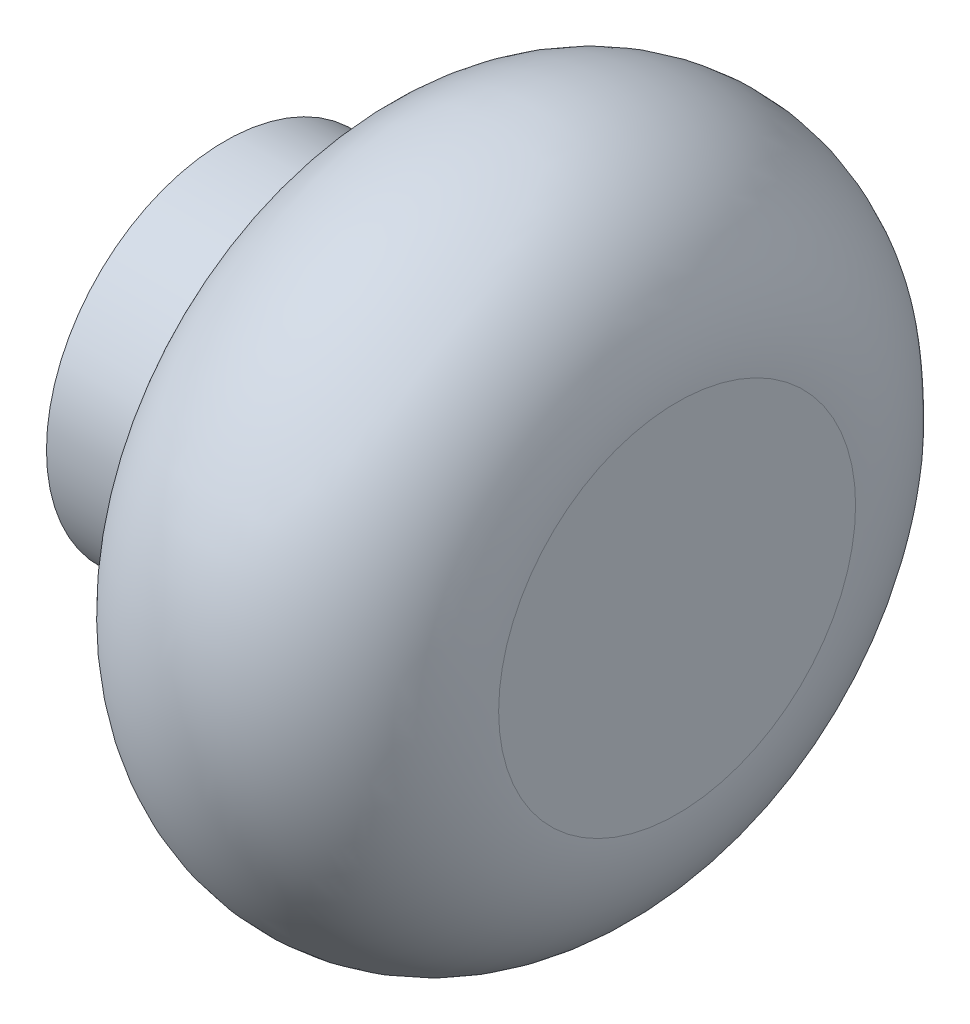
ISO-10303-21;
HEADER;
FILE_DESCRIPTION(('STEP AP214'),'2;1');
FILE_NAME('part.step','',(''),(''),'','','');
FILE_SCHEMA(('AUTOMOTIVE_DESIGN { 1 0 10303 214 1 1 1 1 }'));
ENDSEC;
DATA;
#1=APPLICATION_CONTEXT('core data for automotive mechanical design processes');
#2=APPLICATION_PROTOCOL_DEFINITION('international standard','automotive_design',2000,#1);
#3=PRODUCT_CONTEXT('',#1,'mechanical');
#4=PRODUCT('Part','Part','',(#3));
#5=PRODUCT_RELATED_PRODUCT_CATEGORY('part','',(#4));
#6=PRODUCT_DEFINITION_FORMATION('','',#4);
#7=PRODUCT_DEFINITION_CONTEXT('part definition',#1,'design');
#8=PRODUCT_DEFINITION('design','',#6,#7);
#9=PRODUCT_DEFINITION_SHAPE('','',#8);
#10=(LENGTH_UNIT() NAMED_UNIT(*) SI_UNIT(.MILLI.,.METRE.));
#11=(NAMED_UNIT(*) PLANE_ANGLE_UNIT() SI_UNIT($,.RADIAN.));
#12=(NAMED_UNIT(*) SI_UNIT($,.STERADIAN.) SOLID_ANGLE_UNIT());
#13=UNCERTAINTY_MEASURE_WITH_UNIT(LENGTH_MEASURE(1.E-05),#10,'distance_accuracy_value','');
#14=(GEOMETRIC_REPRESENTATION_CONTEXT(3) GLOBAL_UNCERTAINTY_ASSIGNED_CONTEXT((#13)) GLOBAL_UNIT_ASSIGNED_CONTEXT((#10,
#11,#12)) REPRESENTATION_CONTEXT('',''));
#15=CARTESIAN_POINT('',(0.,0.,0.));
#16=DIRECTION('',(0.,0.,1.));
#17=DIRECTION('',(1.,0.,0.));
#18=AXIS2_PLACEMENT_3D('',#15,#16,#17);
#19=CARTESIAN_POINT('',(10.,0.,0.));
#20=DIRECTION('',(-1.,0.,0.));
#21=DIRECTION('',(0.,0.,1.));
#22=AXIS2_PLACEMENT_3D('',#19,#20,#21);
#23=CYLINDRICAL_SURFACE('',#22,15.);
#24=CARTESIAN_POINT('',(10.,0.,0.));
#25=DIRECTION('',(-1.,0.,0.));
#26=DIRECTION('',(0.,0.,1.));
#27=AXIS2_PLACEMENT_3D('',#24,#25,#26);
#28=CIRCLE('',#27,15.);
#29=CARTESIAN_POINT('',(10.,0.,15.));
#30=VERTEX_POINT('',#29);
#31=EDGE_CURVE('E47',#30,#30,#28,.F.);
#32=ORIENTED_EDGE('',*,*,#31,.F.);
#33=EDGE_LOOP('',(#32));
#34=FACE_BOUND('',#33,.T.);
#35=CARTESIAN_POINT('',(0.,0.,0.));
#36=DIRECTION('',(1.,0.,0.));
#37=DIRECTION('',(0.,0.,-1.));
#38=AXIS2_PLACEMENT_3D('',#35,#36,#37);
#39=CIRCLE('',#38,15.);
#40=CARTESIAN_POINT('',(0.,0.,-15.));
#41=VERTEX_POINT('',#40);
#42=EDGE_CURVE('E170',#41,#41,#39,.T.);
#43=ORIENTED_EDGE('',*,*,#42,.T.);
#44=EDGE_LOOP('',(#43));
#45=FACE_BOUND('',#44,.T.);
#46=ADVANCED_FACE('F36',(#34,#45),#23,.T.);
#47=CARTESIAN_POINT('',(0.,0.,0.));
#48=DIRECTION('',(1.,0.,0.));
#49=DIRECTION('',(0.,0.,-1.));
#50=AXIS2_PLACEMENT_3D('',#47,#48,#49);
#51=PLANE('',#50);
#52=DIRECTION('',(0.,-1.,0.));
#53=VECTOR('',#52,1.);
#54=CARTESIAN_POINT('',(0.,2.78725830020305,-5.05));
#55=LINE('',#54,#53);
#56=CARTESIAN_POINT('',(0.,2.78725830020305,-5.05));
#57=VERTEX_POINT('',#56);
#58=CARTESIAN_POINT('',(0.,-2.78725830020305,-5.05));
#59=VERTEX_POINT('',#58);
#60=EDGE_CURVE('E140',#57,#59,#55,.T.);
#61=ORIENTED_EDGE('',*,*,#60,.F.);
#62=CARTESIAN_POINT('',(0.,3.91862915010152,-3.91862915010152));
#63=DIRECTION('',(-1.,0.,0.));
#64=DIRECTION('',(0.,0.,1.));
#65=AXIS2_PLACEMENT_3D('',#62,#63,#64);
#66=CIRCLE('',#65,1.6);
#67=CARTESIAN_POINT('',(0.,5.05,-2.78725830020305));
#68=VERTEX_POINT('',#67);
#69=EDGE_CURVE('E54',#68,#57,#66,.T.);
#70=ORIENTED_EDGE('',*,*,#69,.F.);
#71=DIRECTION('',(0.,0.,-1.));
#72=VECTOR('',#71,1.);
#73=CARTESIAN_POINT('',(0.,5.05,-2.78725830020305));
#74=LINE('',#73,#72);
#75=CARTESIAN_POINT('',(0.,5.05,2.78725830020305));
#76=VERTEX_POINT('',#75);
#77=EDGE_CURVE('E156',#76,#68,#74,.T.);
#78=ORIENTED_EDGE('',*,*,#77,.F.);
#79=CARTESIAN_POINT('',(0.,3.91862915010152,3.91862915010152));
#80=DIRECTION('',(-1.,0.,0.));
#81=DIRECTION('',(0.,0.,-1.));
#82=AXIS2_PLACEMENT_3D('',#79,#80,#81);
#83=CIRCLE('',#82,1.6);
#84=CARTESIAN_POINT('',(0.,2.78725830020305,5.05));
#85=VERTEX_POINT('',#84);
#86=EDGE_CURVE('E154',#85,#76,#83,.T.);
#87=ORIENTED_EDGE('',*,*,#86,.F.);
#88=DIRECTION('',(0.,1.,0.));
#89=VECTOR('',#88,1.);
#90=CARTESIAN_POINT('',(0.,2.78725830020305,5.05));
#91=LINE('',#90,#89);
#92=CARTESIAN_POINT('',(0.,-2.78725830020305,5.05));
#93=VERTEX_POINT('',#92);
#94=EDGE_CURVE('E114',#93,#85,#91,.T.);
#95=ORIENTED_EDGE('',*,*,#94,.F.);
#96=CARTESIAN_POINT('',(0.,-3.91862915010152,3.91862915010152));
#97=DIRECTION('',(-1.,0.,0.));
#98=DIRECTION('',(0.,0.,1.));
#99=AXIS2_PLACEMENT_3D('',#96,#97,#98);
#100=CIRCLE('',#99,1.6);
#101=CARTESIAN_POINT('',(0.,-5.05,2.78725830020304));
#102=VERTEX_POINT('',#101);
#103=EDGE_CURVE('E150',#102,#93,#100,.T.);
#104=ORIENTED_EDGE('',*,*,#103,.F.);
#105=DIRECTION('',(0.,0.,1.));
#106=VECTOR('',#105,1.);
#107=CARTESIAN_POINT('',(0.,-5.05,-2.78725830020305));
#108=LINE('',#107,#106);
#109=CARTESIAN_POINT('',(0.,-5.05,-2.78725830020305));
#110=VERTEX_POINT('',#109);
#111=EDGE_CURVE('E147',#110,#102,#108,.T.);
#112=ORIENTED_EDGE('',*,*,#111,.F.);
#113=CARTESIAN_POINT('',(0.,-3.91862915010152,-3.91862915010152));
#114=DIRECTION('',(-1.,0.,0.));
#115=DIRECTION('',(0.,0.,-1.));
#116=AXIS2_PLACEMENT_3D('',#113,#114,#115);
#117=CIRCLE('',#116,1.6);
#118=EDGE_CURVE('E144',#59,#110,#117,.T.);
#119=ORIENTED_EDGE('',*,*,#118,.F.);
#120=EDGE_LOOP('',(#61,#70,#78,#87,#95,#104,#112,#119));
#121=FACE_BOUND('',#120,.T.);
#122=ORIENTED_EDGE('',*,*,#42,.F.);
#123=EDGE_LOOP('',(#122));
#124=FACE_BOUND('',#123,.T.);
#125=ADVANCED_FACE('F201',(#121,#124),#51,.F.);
#126=CARTESIAN_POINT('',(23.999999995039,0.,0.));
#127=DIRECTION('',(-1.,0.,0.));
#128=DIRECTION('',(0.,0.,1.));
#129=AXIS2_PLACEMENT_3D('',#126,#127,#128);
#130=TOROIDAL_SURFACE('',#129,14.9996272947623,14.);
#131=CARTESIAN_POINT('',(11.8525704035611,2.2063597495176,-21.8483870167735));
#132=CARTESIAN_POINT('',(11.8312103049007,2.048272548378,-21.8268684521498));
#133=CARTESIAN_POINT('',(11.8123354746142,1.88952061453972,-21.8077490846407));
#134=CARTESIAN_POINT('',(11.7793689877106,1.5706109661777,-21.7742452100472));
#135=CARTESIAN_POINT('',(11.7652895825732,1.41045070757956,-21.7598728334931));
#136=CARTESIAN_POINT('',(11.7484073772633,1.17941729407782,-21.7426247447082));
#137=CARTESIAN_POINT('',(11.7437073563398,1.10881724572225,-21.7378205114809));
#138=CARTESIAN_POINT('',(11.7340501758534,0.94844367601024,-21.7279427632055));
#139=CARTESIAN_POINT('',(11.7293657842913,0.858636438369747,-21.7231463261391));
#140=CARTESIAN_POINT('',(11.7183496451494,0.609099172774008,-21.7118840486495));
#141=CARTESIAN_POINT('',(11.7135631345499,0.449222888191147,-21.7070138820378));
#142=CARTESIAN_POINT('',(11.7087863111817,0.148958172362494,-21.7022617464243));
#143=CARTESIAN_POINT('',(11.708279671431,0.00858499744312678,-21.7018411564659));
#144=CARTESIAN_POINT('',(11.7110184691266,-0.312727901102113,-21.7049127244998));
#145=CARTESIAN_POINT('',(11.7153922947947,-0.493649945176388,-21.7095725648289));
#146=CARTESIAN_POINT('',(11.7291195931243,-0.834404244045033,-21.7240528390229));
#147=CARTESIAN_POINT('',(11.7378484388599,-0.994289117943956,-21.7332242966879));
#148=CARTESIAN_POINT('',(11.7523376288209,-1.20371214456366,-21.7483459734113));
#149=CARTESIAN_POINT('',(11.7560143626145,-1.25355869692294,-21.7521771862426));
#150=CARTESIAN_POINT('',(11.7686109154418,-1.41429162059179,-21.7652774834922));
#151=CARTESIAN_POINT('',(11.7784290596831,-1.5250363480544,-21.7754513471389));
#152=CARTESIAN_POINT('',(11.8053014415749,-1.79558688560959,-21.8031888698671));
#153=CARTESIAN_POINT('',(11.8236267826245,-1.95514111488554,-21.8220210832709));
#154=CARTESIAN_POINT('',(11.8600669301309,-2.23303923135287,-21.8591957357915));
#155=CARTESIAN_POINT('',(11.8770799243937,-2.35167422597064,-21.8764745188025));
#156=CARTESIAN_POINT('',(11.9259056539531,-2.66456337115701,-21.9257312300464));
#157=CARTESIAN_POINT('',(11.9601729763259,-2.85809166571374,-21.9599874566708));
#158=CARTESIAN_POINT('',(12.0291346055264,-3.20340959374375,-22.0280173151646));
#159=CARTESIAN_POINT('',(12.0623520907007,-3.35575327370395,-22.0604978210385));
#160=CARTESIAN_POINT('',(12.1342419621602,-3.65856065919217,-22.1299496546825));
#161=CARTESIAN_POINT('',(12.1729284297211,-3.80901838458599,-22.166932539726));
#162=CARTESIAN_POINT('',(12.256071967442,-4.10827191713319,-22.2453132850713));
#163=CARTESIAN_POINT('',(12.3005644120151,-4.25705090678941,-22.2867379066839));
#164=CARTESIAN_POINT('',(12.3776776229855,-4.49712612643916,-22.3573967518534));
#165=CARTESIAN_POINT('',(12.4085970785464,-4.58931609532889,-22.3854679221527));
#166=CARTESIAN_POINT('',(12.4592972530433,-4.73419741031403,-22.4310145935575));
#167=CARTESIAN_POINT('',(12.4783347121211,-4.78729934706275,-22.4480171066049));
#168=CARTESIAN_POINT('',(12.549862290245,-4.98206211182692,-22.5115043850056));
#169=CARTESIAN_POINT('',(12.6047386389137,-5.12238280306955,-22.5594563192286));
#170=CARTESIAN_POINT('',(12.7207059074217,-5.40114424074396,-22.6589465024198));
#171=CARTESIAN_POINT('',(12.7818588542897,-5.5395470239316,-22.710518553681));
#172=CARTESIAN_POINT('',(12.9107491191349,-5.81448892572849,-22.8170839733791));
#173=CARTESIAN_POINT('',(12.9785648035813,-5.95097695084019,-22.8721143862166));
#174=CARTESIAN_POINT('',(13.1211673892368,-6.22205664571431,-22.9853954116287));
#175=CARTESIAN_POINT('',(13.196048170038,-6.35658342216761,-23.0436833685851));
#176=CARTESIAN_POINT('',(13.3133498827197,-6.55596483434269,-23.1329360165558));
#177=CARTESIAN_POINT('',(13.3535590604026,-6.62244876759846,-23.1631934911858));
#178=CARTESIAN_POINT('',(13.4326712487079,-6.74972978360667,-23.2220357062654));
#179=CARTESIAN_POINT('',(13.4714731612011,-6.81060290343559,-23.2505919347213));
#180=CARTESIAN_POINT('',(13.5907683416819,-6.99311773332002,-23.3374236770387));
#181=CARTESIAN_POINT('',(13.6732925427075,-7.11319992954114,-23.396207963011));
#182=CARTESIAN_POINT('',(13.8450559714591,-7.35104277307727,-23.5157363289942));
#183=CARTESIAN_POINT('',(13.9343848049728,-7.46873038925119,-23.5764967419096));
#184=CARTESIAN_POINT('',(14.1200616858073,-7.70160246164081,-23.6997328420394));
#185=CARTESIAN_POINT('',(14.2165075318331,-7.81670302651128,-23.7622196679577));
#186=CARTESIAN_POINT('',(14.4167226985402,-8.04418610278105,-23.8886356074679));
#187=CARTESIAN_POINT('',(14.5205972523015,-8.15647364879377,-23.9525693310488));
#188=CARTESIAN_POINT('',(14.6677082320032,-8.30784775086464,-24.0406895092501));
#189=CARTESIAN_POINT('',(14.7086232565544,-8.34916753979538,-24.0649503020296));
#190=CARTESIAN_POINT('',(14.8133506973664,-8.45297653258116,-24.126408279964));
#191=CARTESIAN_POINT('',(14.8776911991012,-8.51495235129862,-24.1635754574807));
#192=CARTESIAN_POINT('',(15.0487178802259,-8.67504467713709,-24.2607808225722));
#193=CARTESIAN_POINT('',(15.1568712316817,-8.77168548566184,-24.3206780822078));
#194=CARTESIAN_POINT('',(15.3796472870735,-8.96170905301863,-24.4407520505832));
#195=CARTESIAN_POINT('',(15.4943493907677,-9.05500688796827,-24.5009157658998));
#196=CARTESIAN_POINT('',(15.7303860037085,-9.23808010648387,-24.6212498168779));
#197=CARTESIAN_POINT('',(15.8518026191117,-9.32776216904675,-24.6814008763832));
#198=CARTESIAN_POINT('',(16.1332966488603,-9.5257369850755,-24.8167394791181));
#199=CARTESIAN_POINT('',(16.2947890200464,-9.63232770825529,-24.8914909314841));
#200=CARTESIAN_POINT('',(16.5529897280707,-9.79220420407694,-25.0063063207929));
#201=CARTESIAN_POINT('',(16.6473946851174,-9.84854649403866,-25.0473441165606));
#202=CARTESIAN_POINT('',(16.871747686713,-9.97755443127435,-25.1426251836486));
#203=CARTESIAN_POINT('',(17.0025620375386,-10.0490243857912,-25.1964585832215));
#204=CARTESIAN_POINT('',(17.2697926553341,-10.1876169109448,-25.3028954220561));
#205=CARTESIAN_POINT('',(17.4062637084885,-10.2546574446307,-25.3554679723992));
#206=CARTESIAN_POINT('',(17.6848315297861,-10.3841344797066,-25.4591236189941));
#207=CARTESIAN_POINT('',(17.8269829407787,-10.4464823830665,-25.5101704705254));
#208=CARTESIAN_POINT('',(18.1353576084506,-10.573929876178,-25.6168791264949));
#209=CARTESIAN_POINT('',(18.3020931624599,-10.6381271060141,-25.6721431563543));
#210=CARTESIAN_POINT('',(18.5951327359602,-10.7429940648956,-25.764968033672));
#211=CARTESIAN_POINT('',(18.7205510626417,-10.7854140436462,-25.803365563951));
#212=CARTESIAN_POINT('',(18.9928223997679,-10.8722634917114,-25.8838398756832));
#213=CARTESIAN_POINT('',(19.1400008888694,-10.9159957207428,-25.9255721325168));
#214=CARTESIAN_POINT('',(19.438332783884,-10.9982649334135,-26.0065829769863));
#215=CARTESIAN_POINT('',(19.5895121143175,-11.0367394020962,-26.0458294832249));
#216=CARTESIAN_POINT('',(19.8957489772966,-11.1083098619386,-26.1216709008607));
#217=CARTESIAN_POINT('',(20.0508311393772,-11.1413385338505,-26.1582299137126));
#218=CARTESIAN_POINT('',(20.3647581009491,-11.2018375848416,-26.2284880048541));
#219=CARTESIAN_POINT('',(20.5236257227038,-11.2292359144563,-26.2621471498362));
#220=CARTESIAN_POINT('',(20.837996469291,-11.2772390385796,-26.3249872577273));
#221=CARTESIAN_POINT('',(20.99344999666,-11.298029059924,-26.3542751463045));
#222=CARTESIAN_POINT('',(21.306348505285,-11.3340008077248,-26.4096498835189));
#223=CARTESIAN_POINT('',(21.4637994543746,-11.3491552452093,-26.4357207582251));
#224=CARTESIAN_POINT('',(21.7805236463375,-11.3737708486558,-26.4845689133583));
#225=CARTESIAN_POINT('',(21.939802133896,-11.3832010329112,-26.5073277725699));
#226=CARTESIAN_POINT('',(22.2600094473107,-11.3962961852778,-26.5494542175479));
#227=CARTESIAN_POINT('',(22.4209424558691,-11.3999265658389,-26.5688008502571));
#228=CARTESIAN_POINT('',(22.7239353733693,-11.4012728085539,-26.601785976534));
#229=CARTESIAN_POINT('',(22.8659491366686,-11.3996444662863,-26.6158305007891));
#230=CARTESIAN_POINT('',(23.1894132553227,-11.3908472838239,-26.6445872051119));
#231=CARTESIAN_POINT('',(23.3709075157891,-11.382270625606,-26.6584097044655));
#232=CARTESIAN_POINT('',(23.7132291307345,-11.3592008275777,-26.6801517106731));
#233=CARTESIAN_POINT('',(23.874078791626,-11.3454840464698,-26.6885611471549));
#234=CARTESIAN_POINT('',(24.1951449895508,-11.312350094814,-26.7017578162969));
#235=CARTESIAN_POINT('',(24.3553620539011,-11.292939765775,-26.7065493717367));
#236=CARTESIAN_POINT('',(24.6749774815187,-11.2484721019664,-26.7125380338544));
#237=CARTESIAN_POINT('',(24.8343763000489,-11.2234183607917,-26.7137374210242));
#238=CARTESIAN_POINT('',(25.1124340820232,-11.1746966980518,-26.7127131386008));
#239=CARTESIAN_POINT('',(25.2313132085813,-11.152248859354,-26.7112704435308));
#240=CARTESIAN_POINT('',(25.5500764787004,-11.087716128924,-26.7047054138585));
#241=CARTESIAN_POINT('',(25.7493541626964,-11.0427556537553,-26.6977330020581));
#242=CARTESIAN_POINT('',(26.1044005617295,-10.9542572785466,-26.6802516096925));
#243=CARTESIAN_POINT('',(26.2606325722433,-10.9123532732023,-26.6707741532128));
#244=CARTESIAN_POINT('',(26.570126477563,-10.8233895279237,-26.6484852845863));
#245=CARTESIAN_POINT('',(26.7234018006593,-10.7763702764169,-26.6356990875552));
#246=CARTESIAN_POINT('',(27.0268470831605,-10.6773372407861,-26.6069407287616));
#247=CARTESIAN_POINT('',(27.1770311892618,-10.625360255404,-26.5909912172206));
#248=CARTESIAN_POINT('',(27.4187426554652,-10.5368742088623,-26.5625672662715));
#249=CARTESIAN_POINT('',(27.510968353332,-10.5019514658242,-26.5510605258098));
#250=CARTESIAN_POINT('',(27.6601429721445,-10.4435702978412,-26.5313803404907));
#251=CARTESIAN_POINT('',(27.7173763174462,-10.4207129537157,-26.5235711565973));
#252=CARTESIAN_POINT('',(27.9251751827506,-10.3360398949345,-26.4942835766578));
#253=CARTESIAN_POINT('',(28.0746140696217,-10.2719074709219,-26.4714237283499));
#254=CARTESIAN_POINT('',(28.3686973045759,-10.1391465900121,-26.4229346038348));
#255=CARTESIAN_POINT('',(28.5133783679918,-10.0705851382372,-26.3973439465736));
#256=CARTESIAN_POINT('',(28.7979021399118,-9.92919193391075,-26.3436388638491));
#257=CARTESIAN_POINT('',(28.9377823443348,-9.85642249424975,-26.3155590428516));
#258=CARTESIAN_POINT('',(29.2126758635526,-9.7068353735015,-26.2571102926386));
#259=CARTESIAN_POINT('',(29.3477270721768,-9.63007537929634,-26.2267721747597));
#260=CARTESIAN_POINT('',(29.5471955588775,-9.51173806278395,-26.1795862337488));
#261=CARTESIAN_POINT('',(29.6128904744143,-9.47193769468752,-26.1636500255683));
#262=CARTESIAN_POINT('',(29.7478027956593,-9.38848210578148,-26.1301149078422));
#263=CARTESIAN_POINT('',(29.8169610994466,-9.34474733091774,-26.1124761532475));
#264=CARTESIAN_POINT('',(30.0212564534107,-9.21267510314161,-26.0590582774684));
#265=CARTESIAN_POINT('',(30.1549421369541,-9.12244728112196,-26.0223688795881));
#266=CARTESIAN_POINT('',(30.4160702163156,-8.93846783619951,-25.9473733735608));
#267=CARTESIAN_POINT('',(30.5435779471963,-8.84479461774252,-25.9091020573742));
#268=CARTESIAN_POINT('',(30.7924308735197,-8.65417089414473,-25.8312452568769));
#269=CARTESIAN_POINT('',(30.9138405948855,-8.55729269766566,-25.791688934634));
#270=CARTESIAN_POINT('',(31.1505965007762,-8.36048762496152,-25.7115455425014));
#271=CARTESIAN_POINT('',(31.2660058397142,-8.26062710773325,-25.6709823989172));
#272=CARTESIAN_POINT('',(31.4212772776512,-8.12076361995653,-25.6144373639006));
#273=CARTESIAN_POINT('',(31.4630195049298,-8.08259878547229,-25.599034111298));
#274=CARTESIAN_POINT('',(31.5785163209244,-7.97541214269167,-25.5558605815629));
#275=CARTESIAN_POINT('',(31.6516058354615,-7.90574831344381,-25.5278995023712));
#276=CARTESIAN_POINT('',(31.8373470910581,-7.72388685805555,-25.45524862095));
#277=CARTESIAN_POINT('',(31.9485213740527,-7.61031603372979,-25.410205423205));
#278=CARTESIAN_POINT('',(32.1638210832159,-7.38070136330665,-25.3200610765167));
#279=CARTESIAN_POINT('',(32.2680356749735,-7.2647352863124,-25.2749746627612));
#280=CARTESIAN_POINT('',(32.4696274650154,-7.03052704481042,-25.1850587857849));
#281=CARTESIAN_POINT('',(32.5670894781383,-6.91235467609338,-25.1402374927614));
#282=CARTESIAN_POINT('',(32.7785360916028,-6.64459281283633,-25.0401911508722));
#283=CARTESIAN_POINT('',(32.8912186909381,-6.4939854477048,-24.9849250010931));
#284=CARTESIAN_POINT('',(33.0689907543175,-6.24292562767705,-24.894836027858));
#285=CARTESIAN_POINT('',(33.1364639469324,-6.14418923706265,-24.8599002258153));
#286=CARTESIAN_POINT('',(33.2886271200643,-5.91329081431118,-24.7795246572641));
#287=CARTESIAN_POINT('',(33.3721300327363,-5.78030072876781,-24.7342041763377));
#288=CARTESIAN_POINT('',(33.5319062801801,-5.51280696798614,-24.64534426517));
#289=CARTESIAN_POINT('',(33.6082790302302,-5.37836834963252,-24.6017876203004));
#290=CARTESIAN_POINT('',(33.7541065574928,-5.10802605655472,-24.5167322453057));
#291=CARTESIAN_POINT('',(33.8236497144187,-4.97217677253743,-24.4752121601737));
#292=CARTESIAN_POINT('',(33.9642945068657,-4.68218031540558,-24.3894848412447));
#293=CARTESIAN_POINT('',(34.0347386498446,-4.52765363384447,-24.3454785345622));
#294=CARTESIAN_POINT('',(34.1561765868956,-4.24355040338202,-24.2679936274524));
#295=CARTESIAN_POINT('',(34.208366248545,-4.11460500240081,-24.2340660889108));
#296=CARTESIAN_POINT('',(34.3142096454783,-3.83769949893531,-24.164159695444));
#297=CARTESIAN_POINT('',(34.3672016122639,-3.68941122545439,-24.1284708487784));
#298=CARTESIAN_POINT('',(34.4448098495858,-3.45629333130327,-24.0753568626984));
#299=CARTESIAN_POINT('',(34.4716034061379,-3.37242927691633,-24.0568401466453));
#300=CARTESIAN_POINT('',(34.5177484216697,-3.22173912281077,-24.0246712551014));
#301=CARTESIAN_POINT('',(34.5374735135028,-3.15506960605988,-24.0108199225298));
#302=CARTESIAN_POINT('',(34.5998561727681,-2.93659142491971,-23.9667290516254));
#303=CARTESIAN_POINT('',(34.6399638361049,-2.78375217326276,-23.9379201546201));
#304=CARTESIAN_POINT('',(34.7133813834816,-2.47728178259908,-23.8845437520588));
#305=CARTESIAN_POINT('',(34.7467514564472,-2.32367149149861,-23.8599390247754));
#306=CARTESIAN_POINT('',(34.8075114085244,-2.01258405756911,-23.8146693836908));
#307=CARTESIAN_POINT('',(34.8348181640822,-1.85508260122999,-23.7940596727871));
#308=CARTESIAN_POINT('',(34.8826056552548,-1.53969180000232,-23.7576959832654));
#309=CARTESIAN_POINT('',(34.9031355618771,-1.38181401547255,-23.7419070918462));
#310=CARTESIAN_POINT('',(34.9278951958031,-1.15423887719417,-23.722734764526));
#311=CARTESIAN_POINT('',(34.9347910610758,-1.08498452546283,-23.7173744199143));
#312=CARTESIAN_POINT('',(34.9492750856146,-0.924807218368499,-23.7060755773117));
#313=CARTESIAN_POINT('',(34.9564156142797,-0.833819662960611,-23.7004726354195));
#314=CARTESIAN_POINT('',(34.9732017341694,-0.581339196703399,-23.6872437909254));
#315=CARTESIAN_POINT('',(34.9805322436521,-0.419588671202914,-23.681390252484));
#316=CARTESIAN_POINT('',(34.9878750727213,-0.116072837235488,-23.6754003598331));
#317=CARTESIAN_POINT('',(34.9886876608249,0.0256631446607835,-23.6746407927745));
#318=CARTESIAN_POINT('',(34.984633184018,0.347782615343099,-23.6774987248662));
#319=CARTESIAN_POINT('',(34.9781527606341,0.528139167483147,-23.6823695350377));
#320=CARTESIAN_POINT('',(34.9578913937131,0.868460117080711,-23.6977460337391));
#321=CARTESIAN_POINT('',(34.9449819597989,1.02850713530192,-23.7075806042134));
#322=CARTESIAN_POINT('',(34.9236537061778,1.23807392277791,-23.723756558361));
#323=CARTESIAN_POINT('',(34.9182304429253,1.28808973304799,-23.7278654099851));
#324=CARTESIAN_POINT('',(34.8999475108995,1.44696062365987,-23.7416930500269));
#325=CARTESIAN_POINT('',(34.8858645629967,1.55560041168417,-23.7523101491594));
#326=CARTESIAN_POINT('',(34.8473840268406,1.82215374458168,-23.7811744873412));
#327=CARTESIAN_POINT('',(34.821224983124,1.97968146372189,-23.800682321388));
#328=CARTESIAN_POINT('',(34.7695341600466,2.25469857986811,-23.8388199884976));
#329=CARTESIAN_POINT('',(34.7454035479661,2.37258841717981,-23.8565049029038));
#330=CARTESIAN_POINT('',(34.6763044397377,2.6845561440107,-23.9066698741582));
#331=CARTESIAN_POINT('',(34.6280897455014,2.87759771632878,-23.9412146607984));
#332=CARTESIAN_POINT('',(34.5235443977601,3.25274723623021,-24.0146883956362));
#333=CARTESIAN_POINT('',(34.4675749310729,3.43499688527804,-24.0534108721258));
#334=CARTESIAN_POINT('',(34.3665845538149,3.7356770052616,-24.1217868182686));
#335=CARTESIAN_POINT('',(34.3240800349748,3.85524610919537,-24.1501943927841));
#336=CARTESIAN_POINT('',(34.2241016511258,4.12155788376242,-24.2160110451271));
#337=CARTESIAN_POINT('',(34.1655149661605,4.26776308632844,-24.2539175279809));
#338=CARTESIAN_POINT('',(34.0648431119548,4.50384510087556,-24.317718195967));
#339=CARTESIAN_POINT('',(34.024593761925,4.59470048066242,-24.3429147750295));
#340=CARTESIAN_POINT('',(33.9596221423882,4.73603952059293,-24.383036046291));
#341=CARTESIAN_POINT('',(33.9357184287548,4.78697872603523,-24.3976870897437));
#342=CARTESIAN_POINT('',(33.8460810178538,4.97415134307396,-24.4521969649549));
#343=CARTESIAN_POINT('',(33.7779354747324,5.10902347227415,-24.4928062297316));
#344=CARTESIAN_POINT('',(33.6351208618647,5.37735104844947,-24.5759921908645));
#345=CARTESIAN_POINT('',(33.5603712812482,5.51075730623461,-24.6185889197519));
#346=CARTESIAN_POINT('',(33.4040716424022,5.77613341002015,-24.705501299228));
#347=CARTESIAN_POINT('',(33.3224303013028,5.90804400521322,-24.7498336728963));
#348=CARTESIAN_POINT('',(33.1520623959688,6.17036927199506,-24.83993744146));
#349=CARTESIAN_POINT('',(33.0632349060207,6.30071451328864,-24.8857203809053));
#350=CARTESIAN_POINT('',(32.9251495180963,6.49408298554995,-24.9548962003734));
#351=CARTESIAN_POINT('',(32.8779645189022,6.55862680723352,-24.9782040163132));
#352=CARTESIAN_POINT('',(32.7853317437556,6.68243856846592,-25.0232934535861));
#353=CARTESIAN_POINT('',(32.7399740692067,6.7417741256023,-25.0450745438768));
#354=CARTESIAN_POINT('',(32.6010159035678,6.91971446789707,-25.1108731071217));
#355=CARTESIAN_POINT('',(32.5055233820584,7.03686609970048,-25.1548477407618));
#356=CARTESIAN_POINT('',(32.3081045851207,7.26905169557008,-25.2430777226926));
#357=CARTESIAN_POINT('',(32.2060994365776,7.3840211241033,-25.2873261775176));
#358=CARTESIAN_POINT('',(31.9954602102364,7.61167468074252,-25.3758233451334));
#359=CARTESIAN_POINT('',(31.8867429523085,7.72428679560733,-25.4200592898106));
#360=CARTESIAN_POINT('',(31.6624908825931,7.94703378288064,-25.5082275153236));
#361=CARTESIAN_POINT('',(31.5468692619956,8.0570890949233,-25.5521404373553));
#362=CARTESIAN_POINT('',(31.3840411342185,8.20568798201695,-25.6117360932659));
#363=CARTESIAN_POINT('',(31.3388825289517,8.2462459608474,-25.6280343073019));
#364=CARTESIAN_POINT('',(31.2231372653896,8.34855595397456,-25.6692122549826));
#365=CARTESIAN_POINT('',(31.1520789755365,8.4098376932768,-25.6939381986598));
#366=CARTESIAN_POINT('',(30.9639363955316,8.56814866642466,-25.7579201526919));
#367=CARTESIAN_POINT('',(30.84556664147,8.66384600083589,-25.7967047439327));
#368=CARTESIAN_POINT('',(30.6030774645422,8.85220668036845,-25.8730901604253));
#369=CARTESIAN_POINT('',(30.4788989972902,8.94480448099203,-25.9106650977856));
#370=CARTESIAN_POINT('',(30.2247235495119,9.12674438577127,-25.9843637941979));
#371=CARTESIAN_POINT('',(30.0946667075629,9.21601528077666,-26.0204566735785));
#372=CARTESIAN_POINT('',(29.7948242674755,9.4133443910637,-26.0998747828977));
#373=CARTESIAN_POINT('',(29.6238591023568,9.51990379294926,-26.1424951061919));
#374=CARTESIAN_POINT('',(29.3503814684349,9.68128521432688,-26.2063253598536));
#375=CARTESIAN_POINT('',(29.2497610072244,9.73879583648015,-26.2289163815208));
#376=CARTESIAN_POINT('',(29.0115802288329,9.87060285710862,-26.2802637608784));
#377=CARTESIAN_POINT('',(28.8732930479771,9.94381624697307,-26.3084463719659));
#378=CARTESIAN_POINT('',(28.5920922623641,10.0861250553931,-26.3624140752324));
#379=CARTESIAN_POINT('',(28.4491436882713,10.1551632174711,-26.3881677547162));
#380=CARTESIAN_POINT('',(28.1586669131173,10.2889111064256,-26.4370554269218));
#381=CARTESIAN_POINT('',(28.0111043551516,10.3535590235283,-26.4601543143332));
#382=CARTESIAN_POINT('',(27.6924816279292,10.486213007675,-26.506246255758));
#383=CARTESIAN_POINT('',(27.5210215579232,10.55342415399,-26.5287726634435));
#384=CARTESIAN_POINT('',(27.2182917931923,10.6649422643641,-26.5644773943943));
#385=CARTESIAN_POINT('',(27.087689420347,10.7107748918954,-26.5785848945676));
#386=CARTESIAN_POINT('',(26.8053088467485,10.8050011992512,-26.6062805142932));
#387=CARTESIAN_POINT('',(26.6532782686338,10.8527568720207,-26.6194771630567));
#388=CARTESIAN_POINT('',(26.3464150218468,10.9432154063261,-26.6426433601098));
#389=CARTESIAN_POINT('',(26.1915706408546,10.9858839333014,-26.652591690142));
#390=CARTESIAN_POINT('',(25.8792206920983,11.0660269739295,-26.6691302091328));
#391=CARTESIAN_POINT('',(25.7217041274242,11.1034635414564,-26.6756967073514));
#392=CARTESIAN_POINT('',(25.404166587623,11.1730065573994,-26.6853357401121));
#393=CARTESIAN_POINT('',(25.2441357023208,11.2050714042,-26.6883819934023));
#394=CARTESIAN_POINT('',(24.9252602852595,11.2631056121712,-26.690812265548));
#395=CARTESIAN_POINT('',(24.7664305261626,11.2891540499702,-26.6902469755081));
#396=CARTESIAN_POINT('',(24.4480853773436,11.3356267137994,-26.6855590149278));
#397=CARTESIAN_POINT('',(24.2885703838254,11.3560538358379,-26.681438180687));
#398=CARTESIAN_POINT('',(23.96904162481,11.3912394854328,-26.6696322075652));
#399=CARTESIAN_POINT('',(23.809027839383,11.4059977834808,-26.6619469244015));
#400=CARTESIAN_POINT('',(23.4886874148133,11.4298144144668,-26.6430013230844));
#401=CARTESIAN_POINT('',(23.3283606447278,11.4388692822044,-26.6317388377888));
#402=CARTESIAN_POINT('',(23.0276669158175,11.4504859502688,-26.6072600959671));
#403=CARTESIAN_POINT('',(22.887290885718,11.4537138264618,-26.594459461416));
#404=CARTESIAN_POINT('',(22.5639547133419,11.4560993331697,-26.5617933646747));
#405=CARTESIAN_POINT('',(22.3810767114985,11.4537136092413,-26.5409641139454));
#406=CARTESIAN_POINT('',(22.0376471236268,11.4421045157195,-26.4974418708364));
#407=CARTESIAN_POINT('',(21.8770016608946,11.4337191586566,-26.4752569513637));
#408=CARTESIAN_POINT('',(21.5576841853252,11.4111020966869,-26.4275304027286));
#409=CARTESIAN_POINT('',(21.3990061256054,11.3969083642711,-26.4020112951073));
#410=CARTESIAN_POINT('',(21.0837920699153,11.3627697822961,-26.3477304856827));
#411=CARTESIAN_POINT('',(20.9272489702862,11.3428591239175,-26.3189886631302));
#412=CARTESIAN_POINT('',(20.6551526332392,11.3030575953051,-26.2659171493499));
#413=CARTESIAN_POINT('',(20.5392672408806,11.2844409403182,-26.2423157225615));
#414=CARTESIAN_POINT('',(20.2254253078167,11.2294719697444,-26.1756839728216));
#415=CARTESIAN_POINT('',(20.0283753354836,11.1899925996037,-26.1308865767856));
#416=CARTESIAN_POINT('',(19.6789161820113,11.11088262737,-26.0462107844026));
#417=CARTESIAN_POINT('',(19.5258637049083,11.0730429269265,-26.0072900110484));
#418=CARTESIAN_POINT('',(19.2239349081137,10.991947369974,-25.9268964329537));
#419=CARTESIAN_POINT('',(19.0750306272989,10.9487606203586,-25.8854591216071));
#420=CARTESIAN_POINT('',(18.7814867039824,10.8571771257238,-25.8002448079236));
#421=CARTESIAN_POINT('',(18.6368179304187,10.8088444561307,-25.7564993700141));
#422=CARTESIAN_POINT('',(18.4047970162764,10.7260816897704,-25.6835320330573));
#423=CARTESIAN_POINT('',(18.3165783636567,10.6933581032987,-25.6551164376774));
#424=CARTESIAN_POINT('',(18.1729940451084,10.6380237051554,-25.6077728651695));
#425=CARTESIAN_POINT('',(18.1172913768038,10.6160382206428,-25.5891323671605));
#426=CARTESIAN_POINT('',(17.9156094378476,10.5345292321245,-25.5206520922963));
#427=CARTESIAN_POINT('',(17.7710404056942,10.4724431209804,-25.4696663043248));
#428=CARTESIAN_POINT('',(17.4878139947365,10.3433804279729,-25.3660820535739));
#429=CARTESIAN_POINT('',(17.3490989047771,10.2764987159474,-25.3135227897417));
#430=CARTESIAN_POINT('',(17.0775502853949,10.1381248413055,-25.2070772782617));
#431=CARTESIAN_POINT('',(16.9446587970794,10.0667207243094,-25.1532244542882));
#432=CARTESIAN_POINT('',(16.6847113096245,9.91957509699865,-25.0444596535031));
#433=CARTESIAN_POINT('',(16.5575976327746,9.84391487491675,-24.9895757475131));
#434=CARTESIAN_POINT('',(16.3705953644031,9.72695982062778,-24.9063497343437));
#435=CARTESIAN_POINT('',(16.309202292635,9.68762429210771,-24.8786135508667));
#436=CARTESIAN_POINT('',(16.1826240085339,9.60455234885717,-24.8205797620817));
#437=CARTESIAN_POINT('',(16.1175200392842,9.56071304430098,-24.7902521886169));
#438=CARTESIAN_POINT('',(15.9258251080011,9.42827434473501,-24.699555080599));
#439=CARTESIAN_POINT('',(15.8009455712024,9.33756666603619,-24.6386233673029));
#440=CARTESIAN_POINT('',(15.5582992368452,9.15228979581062,-24.5166960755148));
#441=CARTESIAN_POINT('',(15.4404439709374,9.05782200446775,-24.4557221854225));
#442=CARTESIAN_POINT('',(15.2116615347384,8.86532266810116,-24.3340168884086));
#443=CARTESIAN_POINT('',(15.1006487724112,8.76738351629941,-24.2733002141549));
#444=CARTESIAN_POINT('',(14.8853506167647,8.56821432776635,-24.1523885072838));
#445=CARTESIAN_POINT('',(14.7809832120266,8.46706793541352,-24.0922020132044));
#446=CARTESIAN_POINT('',(14.6412715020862,8.32520830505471,-24.0095749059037));
#447=CARTESIAN_POINT('',(14.6038152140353,8.28651263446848,-23.9872114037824));
#448=CARTESIAN_POINT('',(14.4998682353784,8.17725086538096,-23.9245684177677));
#449=CARTESIAN_POINT('',(14.4341361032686,8.10596732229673,-23.8842769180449));
#450=CARTESIAN_POINT('',(14.2677804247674,7.91980120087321,-23.7806284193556));
#451=CARTESIAN_POINT('',(14.1688130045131,7.80340410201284,-23.7173221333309));
#452=CARTESIAN_POINT('',(13.9783653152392,7.56786782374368,-23.592465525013));
#453=CARTESIAN_POINT('',(13.8867806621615,7.44881873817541,-23.5309043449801));
#454=CARTESIAN_POINT('',(13.7107647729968,7.20820119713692,-23.4098132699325));
#455=CARTESIAN_POINT('',(13.6262376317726,7.08671122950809,-23.3502666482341));
#456=CARTESIAN_POINT('',(13.4440622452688,6.8112400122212,-23.219088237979));
#457=CARTESIAN_POINT('',(13.3478149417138,6.65616492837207,-23.1477956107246));
#458=CARTESIAN_POINT('',(13.1976253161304,6.39808117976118,-23.0336918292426));
#459=CARTESIAN_POINT('',(13.1411441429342,6.29690248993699,-22.9900501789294));
#460=CARTESIAN_POINT('',(13.0143508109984,6.05997979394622,-22.8905513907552));
#461=CARTESIAN_POINT('',(12.9452740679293,5.92337085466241,-22.8351681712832));
#462=CARTESIAN_POINT('',(12.8139690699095,5.64822772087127,-22.7278869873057));
#463=CARTESIAN_POINT('',(12.7516579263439,5.50974790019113,-22.675950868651));
#464=CARTESIAN_POINT('',(12.6334764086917,5.23088467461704,-22.5757350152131));
#465=CARTESIAN_POINT('',(12.5775394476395,5.09054225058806,-22.5274197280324));
#466=CARTESIAN_POINT('',(12.4651567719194,4.79041032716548,-22.4288183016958));
#467=CARTESIAN_POINT('',(12.4093854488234,4.6302333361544,-22.3789394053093));
#468=CARTESIAN_POINT('',(12.31488933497,4.33793512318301,-22.2931026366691));
#469=CARTESIAN_POINT('',(12.2749619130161,4.20643914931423,-22.2563276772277));
#470=CARTESIAN_POINT('',(12.1943145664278,3.92321693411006,-22.1812154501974));
#471=CARTESIAN_POINT('',(12.1542320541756,3.77118188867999,-22.1433515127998));
#472=CARTESIAN_POINT('',(12.0959585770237,3.53196675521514,-22.0877057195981));
#473=CARTESIAN_POINT('',(12.0758775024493,3.4455926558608,-22.0684005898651));
#474=CARTESIAN_POINT('',(12.0415837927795,3.29093168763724,-22.0352410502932));
#475=CARTESIAN_POINT('',(12.0270417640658,3.22277665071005,-22.0211113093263));
#476=CARTESIAN_POINT('',(11.9810028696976,2.9983775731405,-21.976195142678));
#477=CARTESIAN_POINT('',(11.9516890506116,2.8412987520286,-21.9472956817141));
#478=CARTESIAN_POINT('',(11.8982511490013,2.52515506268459,-21.8942335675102));
#479=CARTESIAN_POINT('',(11.8741368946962,2.36608702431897,-21.8700798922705));
#480=CARTESIAN_POINT('',(11.8525704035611,2.2063597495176,-21.8483870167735));
#481=B_SPLINE_CURVE_WITH_KNOTS('',3,(#131,#132,#133,#134,#135,#136,#137,#138,#139,#140,#141,
#142,#143,#144,#145,#146,#147,#148,#149,#150,#151,#152,#153,#154,#155,#156,#157,#158,#159,#160,
#161,#162,#163,#164,#165,#166,#167,#168,#169,#170,#171,#172,#173,#174,#175,#176,#177,#178,#179,
#180,#181,#182,#183,#184,#185,#186,#187,#188,#189,#190,#191,#192,#193,#194,#195,#196,#197,#198,
#199,#200,#201,#202,#203,#204,#205,#206,#207,#208,#209,#210,#211,#212,#213,#214,#215,#216,#217,
#218,#219,#220,#221,#222,#223,#224,#225,#226,#227,#228,#229,#230,#231,#232,#233,#234,#235,#236,
#237,#238,#239,#240,#241,#242,#243,#244,#245,#246,#247,#248,#249,#250,#251,#252,#253,#254,#255,
#256,#257,#258,#259,#260,#261,#262,#263,#264,#265,#266,#267,#268,#269,#270,#271,#272,#273,#274,
#275,#276,#277,#278,#279,#280,#281,#282,#283,#284,#285,#286,#287,#288,#289,#290,#291,#292,#293,
#294,#295,#296,#297,#298,#299,#300,#301,#302,#303,#304,#305,#306,#307,#308,#309,#310,#311,#312,
#313,#314,#315,#316,#317,#318,#319,#320,#321,#322,#323,#324,#325,#326,#327,#328,#329,#330,#331,
#332,#333,#334,#335,#336,#337,#338,#339,#340,#341,#342,#343,#344,#345,#346,#347,#348,#349,#350,
#351,#352,#353,#354,#355,#356,#357,#358,#359,#360,#361,#362,#363,#364,#365,#366,#367,#368,#369,
#370,#371,#372,#373,#374,#375,#376,#377,#378,#379,#380,#381,#382,#383,#384,#385,#386,#387,#388,
#389,#390,#391,#392,#393,#394,#395,#396,#397,#398,#399,#400,#401,#402,#403,#404,#405,#406,#407,
#408,#409,#410,#411,#412,#413,#414,#415,#416,#417,#418,#419,#420,#421,#422,#423,#424,#425,#426,
#427,#428,#429,#430,#431,#432,#433,#434,#435,#436,#437,#438,#439,#440,#441,#442,#443,#444,#445,
#446,#447,#448,#449,#450,#451,#452,#453,#454,#455,#456,#457,#458,#459,#460,#461,#462,#463,#464,
#465,#466,#467,#468,#469,#470,#471,#472,#473,#474,#475,#476,#477,#478,#479,#480),.UNSPECIFIED.,
.F.,.F.,(4,2,2,2,2,2,2,2,2,2,2,2,2,2,2,2,2,2,2,2,2,2,2,2,2,2,2,2,2,2,2,2,2,2,2,2,2,2,2,2,2,2,2,
2,2,2,2,2,2,2,2,2,2,2,2,2,2,2,2,2,2,2,2,2,2,2,2,2,2,2,2,2,2,2,2,2,2,2,2,2,2,2,2,2,2,2,2,2,2,2,2,
2,2,2,2,2,2,2,2,2,2,2,2,2,2,2,2,2,2,2,2,2,2,2,2,2,2,2,2,2,2,2,2,2,2,2,2,2,2,2,2,2,2,2,2,2,2,2,2,
2,2,2,2,2,2,2,2,2,2,2,2,2,2,2,2,2,2,2,2,2,2,2,2,2,2,2,2,2,2,2,2,2,2,2,4),(0.,0.482876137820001,
0.966976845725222,1.17972547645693,1.44987554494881,1.92979447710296,2.35084116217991,
2.89374966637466,3.37475706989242,3.52514048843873,3.86002490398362,4.34496447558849,
4.70817657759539,5.30633921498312,5.78399502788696,6.26290387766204,6.74488020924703,
7.04846084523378,7.22520917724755,7.69937418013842,8.17878406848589,8.66472658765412,
9.15841394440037,9.4085374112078,9.64141487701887,10.1126000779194,10.5917113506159,
11.0794965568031,11.5766710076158,11.7656873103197,12.0559278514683,12.5265402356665,
13.0052682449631,13.492591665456,14.1145260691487,14.4665277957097,14.941835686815,
15.4243277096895,15.9143797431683,16.4751845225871,16.8886608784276,17.3658376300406,
17.8482691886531,18.3362778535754,18.8301882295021,19.3086945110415,19.7894885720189,
20.2728621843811,20.759107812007,21.1871648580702,21.7336129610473,22.2184320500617,
22.7026709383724,23.1866023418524,23.5495214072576,24.1624237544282,24.6483891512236,
25.1307549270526,25.6097840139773,25.907609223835,26.0939689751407,26.5864644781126,
27.0727405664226,27.5530832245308,28.0277757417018,28.2631022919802,28.5142048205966,
29.0102672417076,29.4984760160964,29.9791962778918,30.4528003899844,30.6286543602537,
30.9429312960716,31.4383440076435,31.9251092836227,32.403789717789,32.9916553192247,
33.3653642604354,33.8555290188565,34.3372887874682,34.8116341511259,35.3377223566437,
35.7671701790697,36.251373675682,36.5212439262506,36.7339097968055,37.2155577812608,
37.6926915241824,38.1760099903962,38.6557403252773,38.8651352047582,39.1394161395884,
39.6252277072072,40.0503098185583,40.59159566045,41.0739584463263,41.2253842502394,
41.5555017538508,42.0378863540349,42.4026957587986,43.0081305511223,43.5914295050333,
43.9814713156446,44.4672945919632,44.774804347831,44.9492344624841,45.4184936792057,
45.894582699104,46.3784642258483,46.8710373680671,47.1208614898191,47.3542406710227,
47.8263261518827,48.3060181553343,48.793860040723,49.2903693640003,49.4789083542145,
49.7699900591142,50.241097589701,50.7191517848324,51.2044982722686,51.8219298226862,
52.1761215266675,52.6529550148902,53.1352899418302,53.6234070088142,54.1797929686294,
54.5970987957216,55.0766611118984,55.5592960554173,56.0452675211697,56.5348441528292,
57.0175644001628,57.5000354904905,57.9825261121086,58.4653095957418,58.8882093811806,
59.4402095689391,59.927226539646,60.4111092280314,60.8921561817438,61.2512707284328,
61.8686204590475,62.3556605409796,62.8369591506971,63.3128433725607,63.6076781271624,
63.7958278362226,64.2918207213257,64.7798252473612,65.2602281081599,65.7334129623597,
65.9674305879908,66.2198428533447,66.7174740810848,67.2059739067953,67.6858471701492,
68.1576065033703,68.3325419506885,68.6475053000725,69.1434641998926,69.630281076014,
70.1087294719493,70.6962357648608,71.0676388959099,71.5558259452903,72.0371237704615,
72.5128136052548,73.0429427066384,73.469613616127,73.9545947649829,74.2268320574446,
74.4401416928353,74.9271132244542,75.4149973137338),.UNSPECIFIED.);
#482=CARTESIAN_POINT('',(11.8525704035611,2.2063597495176,-21.8483870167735));
#483=VERTEX_POINT('',#482);
#484=EDGE_CURVE('E11',#483,#483,#481,.T.);
#485=ORIENTED_EDGE('',*,*,#484,.T.);
#486=EDGE_LOOP('',(#485));
#487=FACE_BOUND('',#486,.T.);
#488=ORIENTED_EDGE('',*,*,#31,.T.);
#489=EDGE_LOOP('',(#488));
#490=FACE_BOUND('',#489,.T.);
#491=CARTESIAN_POINT('',(37.9999999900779,0.,0.));
#492=DIRECTION('',(-1.,0.,0.));
#493=DIRECTION('',(0.,0.,1.));
#494=AXIS2_PLACEMENT_3D('',#491,#492,#493);
#495=CIRCLE('',#494,14.9992545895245);
#496=CARTESIAN_POINT('',(37.9999999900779,0.,14.9992545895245));
#497=VERTEX_POINT('',#496);
#498=EDGE_CURVE('E160',#497,#497,#495,.T.);
#499=ORIENTED_EDGE('',*,*,#498,.T.);
#500=EDGE_LOOP('',(#499));
#501=FACE_BOUND('',#500,.T.);
#502=ADVANCED_FACE('F190',(#487,#490,#501),#130,.T.);
#503=CARTESIAN_POINT('',(37.9999999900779,14.9992545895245,0.));
#504=DIRECTION('',(-1.,0.,0.));
#505=DIRECTION('',(0.,0.,1.));
#506=AXIS2_PLACEMENT_3D('',#503,#504,#505);
#507=PLANE('',#506);
#508=ORIENTED_EDGE('',*,*,#498,.F.);
#509=EDGE_LOOP('',(#508));
#510=FACE_BOUND('',#509,.T.);
#511=ADVANCED_FACE('F200',(#510),#507,.F.);
#512=CARTESIAN_POINT('',(20.,3.91862915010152,-3.91862915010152));
#513=DIRECTION('',(-1.,0.,0.));
#514=DIRECTION('',(0.,0.,1.));
#515=AXIS2_PLACEMENT_3D('',#512,#513,#514);
#516=CYLINDRICAL_SURFACE('',#515,1.6);
#517=ORIENTED_EDGE('',*,*,#69,.T.);
#518=DIRECTION('',(-1.,0.,0.));
#519=VECTOR('',#518,1.);
#520=CARTESIAN_POINT('',(20.,2.78725830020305,-5.05));
#521=LINE('',#520,#519);
#522=CARTESIAN_POINT('',(20.,2.78725830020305,-5.05));
#523=VERTEX_POINT('',#522);
#524=EDGE_CURVE('E90',#523,#57,#521,.T.);
#525=ORIENTED_EDGE('',*,*,#524,.F.);
#526=CARTESIAN_POINT('',(20.,3.91862915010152,-3.91862915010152));
#527=DIRECTION('',(-1.,0.,0.));
#528=DIRECTION('',(0.,0.,1.));
#529=AXIS2_PLACEMENT_3D('',#526,#527,#528);
#530=CIRCLE('',#529,1.6);
#531=CARTESIAN_POINT('',(20.,5.05,-2.78725830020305));
#532=VERTEX_POINT('',#531);
#533=EDGE_CURVE('E158',#532,#523,#530,.T.);
#534=ORIENTED_EDGE('',*,*,#533,.F.);
#535=DIRECTION('',(-1.,0.,0.));
#536=VECTOR('',#535,1.);
#537=CARTESIAN_POINT('',(20.,5.05,-2.78725830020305));
#538=LINE('',#537,#536);
#539=EDGE_CURVE('E62',#532,#68,#538,.T.);
#540=ORIENTED_EDGE('',*,*,#539,.T.);
#541=EDGE_LOOP('',(#517,#525,#534,#540));
#542=FACE_BOUND('',#541,.T.);
#543=ADVANCED_FACE('F256',(#542),#516,.F.);
#544=CARTESIAN_POINT('',(20.,5.05,-2.78725830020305));
#545=DIRECTION('',(0.,1.,0.));
#546=DIRECTION('',(0.,0.,1.));
#547=AXIS2_PLACEMENT_3D('',#544,#545,#546);
#548=PLANE('',#547);
#549=ORIENTED_EDGE('',*,*,#77,.T.);
#550=ORIENTED_EDGE('',*,*,#539,.F.);
#551=DIRECTION('',(0.,0.,-1.));
#552=VECTOR('',#551,1.);
#553=CARTESIAN_POINT('',(20.,5.05,-2.78725830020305));
#554=LINE('',#553,#552);
#555=CARTESIAN_POINT('',(20.,5.05,2.78725830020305));
#556=VERTEX_POINT('',#555);
#557=EDGE_CURVE('E126',#556,#532,#554,.T.);
#558=ORIENTED_EDGE('',*,*,#557,.F.);
#559=DIRECTION('',(-1.,0.,0.));
#560=VECTOR('',#559,1.);
#561=CARTESIAN_POINT('',(20.,5.05,2.78725830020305));
#562=LINE('',#561,#560);
#563=EDGE_CURVE('E118',#556,#76,#562,.T.);
#564=ORIENTED_EDGE('',*,*,#563,.T.);
#565=EDGE_LOOP('',(#549,#550,#558,#564));
#566=FACE_BOUND('',#565,.T.);
#567=ADVANCED_FACE('F255',(#566),#548,.F.);
#568=CARTESIAN_POINT('',(20.,3.91862915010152,3.91862915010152));
#569=DIRECTION('',(-1.,0.,0.));
#570=DIRECTION('',(0.,0.,1.));
#571=AXIS2_PLACEMENT_3D('',#568,#569,#570);
#572=CYLINDRICAL_SURFACE('',#571,1.6);
#573=ORIENTED_EDGE('',*,*,#86,.T.);
#574=ORIENTED_EDGE('',*,*,#563,.F.);
#575=CARTESIAN_POINT('',(20.,3.91862915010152,3.91862915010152));
#576=DIRECTION('',(-1.,0.,0.));
#577=DIRECTION('',(0.,0.,-1.));
#578=AXIS2_PLACEMENT_3D('',#575,#576,#577);
#579=CIRCLE('',#578,1.6);
#580=CARTESIAN_POINT('',(20.,2.78725830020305,5.05));
#581=VERTEX_POINT('',#580);
#582=EDGE_CURVE('E122',#581,#556,#579,.T.);
#583=ORIENTED_EDGE('',*,*,#582,.F.);
#584=DIRECTION('',(-1.,0.,0.));
#585=VECTOR('',#584,1.);
#586=CARTESIAN_POINT('',(20.,2.78725830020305,5.05));
#587=LINE('',#586,#585);
#588=EDGE_CURVE('E107',#581,#85,#587,.T.);
#589=ORIENTED_EDGE('',*,*,#588,.T.);
#590=EDGE_LOOP('',(#573,#574,#583,#589));
#591=FACE_BOUND('',#590,.T.);
#592=ADVANCED_FACE('F123',(#591),#572,.F.);
#593=CARTESIAN_POINT('',(20.,2.78725830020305,5.05));
#594=DIRECTION('',(0.,0.,1.));
#595=DIRECTION('',(1.,0.,0.));
#596=AXIS2_PLACEMENT_3D('',#593,#594,#595);
#597=PLANE('',#596);
#598=ORIENTED_EDGE('',*,*,#94,.T.);
#599=ORIENTED_EDGE('',*,*,#588,.F.);
#600=DIRECTION('',(0.,1.,0.));
#601=VECTOR('',#600,1.);
#602=CARTESIAN_POINT('',(20.,2.78725830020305,5.05));
#603=LINE('',#602,#601);
#604=CARTESIAN_POINT('',(20.,-2.78725830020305,5.05));
#605=VERTEX_POINT('',#604);
#606=EDGE_CURVE('E111',#605,#581,#603,.T.);
#607=ORIENTED_EDGE('',*,*,#606,.F.);
#608=DIRECTION('',(-1.,0.,0.));
#609=VECTOR('',#608,1.);
#610=CARTESIAN_POINT('',(20.,-2.78725830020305,5.05));
#611=LINE('',#610,#609);
#612=EDGE_CURVE('E119',#605,#93,#611,.T.);
#613=ORIENTED_EDGE('',*,*,#612,.T.);
#614=EDGE_LOOP('',(#598,#599,#607,#613));
#615=FACE_BOUND('',#614,.T.);
#616=ADVANCED_FACE('F109',(#615),#597,.F.);
#617=CARTESIAN_POINT('',(20.,-3.91862915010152,3.91862915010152));
#618=DIRECTION('',(-1.,0.,0.));
#619=DIRECTION('',(0.,0.,1.));
#620=AXIS2_PLACEMENT_3D('',#617,#618,#619);
#621=CYLINDRICAL_SURFACE('',#620,1.6);
#622=ORIENTED_EDGE('',*,*,#103,.T.);
#623=ORIENTED_EDGE('',*,*,#612,.F.);
#624=CARTESIAN_POINT('',(20.,-3.91862915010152,3.91862915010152));
#625=DIRECTION('',(-1.,0.,0.));
#626=DIRECTION('',(0.,0.,1.));
#627=AXIS2_PLACEMENT_3D('',#624,#625,#626);
#628=CIRCLE('',#627,1.6);
#629=CARTESIAN_POINT('',(20.,-5.05,2.78725830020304));
#630=VERTEX_POINT('',#629);
#631=EDGE_CURVE('E132',#630,#605,#628,.T.);
#632=ORIENTED_EDGE('',*,*,#631,.F.);
#633=DIRECTION('',(-1.,0.,0.));
#634=VECTOR('',#633,1.);
#635=CARTESIAN_POINT('',(20.,-5.05,2.78725830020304));
#636=LINE('',#635,#634);
#637=EDGE_CURVE('E163',#630,#102,#636,.T.);
#638=ORIENTED_EDGE('',*,*,#637,.T.);
#639=EDGE_LOOP('',(#622,#623,#632,#638));
#640=FACE_BOUND('',#639,.T.);
#641=ADVANCED_FACE('F250',(#640),#621,.F.);
#642=CARTESIAN_POINT('',(20.,-5.05,-2.78725830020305));
#643=DIRECTION('',(0.,-1.,0.));
#644=DIRECTION('',(0.,0.,-1.));
#645=AXIS2_PLACEMENT_3D('',#642,#643,#644);
#646=PLANE('',#645);
#647=ORIENTED_EDGE('',*,*,#111,.T.);
#648=ORIENTED_EDGE('',*,*,#637,.F.);
#649=DIRECTION('',(0.,0.,1.));
#650=VECTOR('',#649,1.);
#651=CARTESIAN_POINT('',(20.,-5.05,-2.78725830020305));
#652=LINE('',#651,#650);
#653=CARTESIAN_POINT('',(20.,-5.05,-2.78725830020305));
#654=VERTEX_POINT('',#653);
#655=EDGE_CURVE('E134',#654,#630,#652,.T.);
#656=ORIENTED_EDGE('',*,*,#655,.F.);
#657=DIRECTION('',(-1.,0.,0.));
#658=VECTOR('',#657,1.);
#659=CARTESIAN_POINT('',(20.,-5.05,-2.78725830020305));
#660=LINE('',#659,#658);
#661=EDGE_CURVE('E165',#654,#110,#660,.T.);
#662=ORIENTED_EDGE('',*,*,#661,.T.);
#663=EDGE_LOOP('',(#647,#648,#656,#662));
#664=FACE_BOUND('',#663,.T.);
#665=ADVANCED_FACE('F246',(#664),#646,.F.);
#666=CARTESIAN_POINT('',(20.,-3.91862915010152,-3.91862915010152));
#667=DIRECTION('',(-1.,0.,0.));
#668=DIRECTION('',(0.,0.,1.));
#669=AXIS2_PLACEMENT_3D('',#666,#667,#668);
#670=CYLINDRICAL_SURFACE('',#669,1.6);
#671=ORIENTED_EDGE('',*,*,#118,.T.);
#672=ORIENTED_EDGE('',*,*,#661,.F.);
#673=CARTESIAN_POINT('',(20.,-3.91862915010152,-3.91862915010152));
#674=DIRECTION('',(-1.,0.,0.));
#675=DIRECTION('',(0.,0.,-1.));
#676=AXIS2_PLACEMENT_3D('',#673,#674,#675);
#677=CIRCLE('',#676,1.6);
#678=CARTESIAN_POINT('',(20.,-2.78725830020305,-5.05));
#679=VERTEX_POINT('',#678);
#680=EDGE_CURVE('E241',#679,#654,#677,.T.);
#681=ORIENTED_EDGE('',*,*,#680,.F.);
#682=DIRECTION('',(-1.,0.,0.));
#683=VECTOR('',#682,1.);
#684=CARTESIAN_POINT('',(20.,-2.78725830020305,-5.05));
#685=LINE('',#684,#683);
#686=EDGE_CURVE('E167',#679,#59,#685,.T.);
#687=ORIENTED_EDGE('',*,*,#686,.T.);
#688=EDGE_LOOP('',(#671,#672,#681,#687));
#689=FACE_BOUND('',#688,.T.);
#690=ADVANCED_FACE('F325',(#689),#670,.F.);
#691=CARTESIAN_POINT('',(20.,2.78725830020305,-5.05));
#692=DIRECTION('',(0.,0.,-1.));
#693=DIRECTION('',(-1.,0.,0.));
#694=AXIS2_PLACEMENT_3D('',#691,#692,#693);
#695=PLANE('',#694);
#696=ORIENTED_EDGE('',*,*,#60,.T.);
#697=ORIENTED_EDGE('',*,*,#686,.F.);
#698=DIRECTION('',(0.,-1.,0.));
#699=VECTOR('',#698,1.);
#700=CARTESIAN_POINT('',(20.,2.78725830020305,-5.05));
#701=LINE('',#700,#699);
#702=EDGE_CURVE('E238',#523,#679,#701,.T.);
#703=ORIENTED_EDGE('',*,*,#702,.F.);
#704=ORIENTED_EDGE('',*,*,#524,.T.);
#705=EDGE_LOOP('',(#696,#697,#703,#704));
#706=FACE_BOUND('',#705,.T.);
#707=ADVANCED_FACE('F321',(#706),#695,.F.);
#708=CARTESIAN_POINT('',(20.,3.91862915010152,-3.91862915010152));
#709=DIRECTION('',(-1.,0.,0.));
#710=DIRECTION('',(0.,0.,1.));
#711=AXIS2_PLACEMENT_3D('',#708,#709,#710);
#712=PLANE('',#711);
#713=ORIENTED_EDGE('',*,*,#533,.T.);
#714=ORIENTED_EDGE('',*,*,#702,.T.);
#715=ORIENTED_EDGE('',*,*,#680,.T.);
#716=ORIENTED_EDGE('',*,*,#655,.T.);
#717=ORIENTED_EDGE('',*,*,#631,.T.);
#718=ORIENTED_EDGE('',*,*,#606,.T.);
#719=ORIENTED_EDGE('',*,*,#582,.T.);
#720=ORIENTED_EDGE('',*,*,#557,.T.);
#721=EDGE_LOOP('',(#713,#714,#715,#716,#717,#718,#719,#720));
#722=FACE_BOUND('',#721,.T.);
#723=ADVANCED_FACE('F129',(#722),#712,.T.);
#724=CARTESIAN_POINT('',(-399977.423726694,-291592.385766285,-23.9996272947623));
#725=DIRECTION('',(0.,0.,1.));
#726=DIRECTION('',(1.,0.,0.));
#727=AXIS2_PLACEMENT_3D('',#724,#725,#726);
#728=PLANE('',#727);
#729=CARTESIAN_POINT('',(27.5762733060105,0.0266897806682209,-23.9996272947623));
#730=CARTESIAN_POINT('',(27.5762761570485,-0.0551227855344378,-23.9996272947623));
#731=CARTESIAN_POINT('',(27.5742659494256,-0.13693494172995,-23.9996272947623));
#732=CARTESIAN_POINT('',(27.5662352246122,-0.300362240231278,-23.9996272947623));
#733=CARTESIAN_POINT('',(27.5602147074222,-0.381977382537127,-23.9996272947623));
#734=CARTESIAN_POINT('',(27.5441709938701,-0.544897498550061,-23.9996272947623));
#735=CARTESIAN_POINT('',(27.5341437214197,-0.626202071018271,-23.9996272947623));
#736=CARTESIAN_POINT('',(27.5101261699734,-0.788054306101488,-23.9996272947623));
#737=CARTESIAN_POINT('',(27.4961440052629,-0.868603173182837,-23.9996272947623));
#738=CARTESIAN_POINT('',(27.4642220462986,-1.02908822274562,-23.9996272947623));
#739=CARTESIAN_POINT('',(27.4462740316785,-1.10902277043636,-23.9996272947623));
#740=CARTESIAN_POINT('',(27.4065081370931,-1.26774154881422,-23.9996272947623));
#741=CARTESIAN_POINT('',(27.3846986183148,-1.34652787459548,-23.9996272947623));
#742=CARTESIAN_POINT('',(27.3371992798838,-1.50311099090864,-23.9996272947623));
#743=CARTESIAN_POINT('',(27.3115010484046,-1.58090522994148,-23.9996272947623));
#744=CARTESIAN_POINT('',(27.2563692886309,-1.73496192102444,-23.9996272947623));
#745=CARTESIAN_POINT('',(27.2269442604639,-1.81122741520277,-23.9996272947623));
#746=CARTESIAN_POINT('',(27.1643290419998,-1.96239304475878,-23.9996272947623));
#747=CARTESIAN_POINT('',(27.1311307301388,-2.0372898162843,-23.9996272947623));
#748=CARTESIAN_POINT('',(27.0611643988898,-2.18520089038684,-23.9996272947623));
#749=CARTESIAN_POINT('',(27.0244041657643,-2.25821887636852,-23.9996272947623));
#750=CARTESIAN_POINT('',(26.9472725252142,-2.4025233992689,-23.9996272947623));
#751=CARTESIAN_POINT('',(26.9068935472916,-2.47380589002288,-23.9996272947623));
#752=CARTESIAN_POINT('',(26.8227662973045,-2.61414684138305,-23.9996272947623));
#753=CARTESIAN_POINT('',(26.7790254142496,-2.68320973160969,-23.9996272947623));
#754=CARTESIAN_POINT('',(26.6881176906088,-2.81926214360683,-23.9996272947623));
#755=CARTESIAN_POINT('',(26.6409435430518,-2.88624678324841,-23.9996272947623));
#756=CARTESIAN_POINT('',(26.5434654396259,-3.01766593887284,-23.9996272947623));
#757=CARTESIAN_POINT('',(26.4931687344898,-3.08210583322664,-23.9996272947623));
#758=CARTESIAN_POINT('',(26.3893686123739,-3.20858611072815,-23.9996272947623));
#759=CARTESIAN_POINT('',(26.3358583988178,-3.27062091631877,-23.9996272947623));
#760=CARTESIAN_POINT('',(26.225968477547,-3.3918528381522,-23.9996272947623));
#761=CARTESIAN_POINT('',(26.1695951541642,-3.45105574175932,-23.9996272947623));
#762=CARTESIAN_POINT('',(26.0538953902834,-3.5667563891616,-23.9996272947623));
#763=CARTESIAN_POINT('',(25.9945628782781,-3.62324806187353,-23.9996272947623));
#764=CARTESIAN_POINT('',(25.8733193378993,-3.73312518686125,-23.9996272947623));
#765=CARTESIAN_POINT('',(25.8114140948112,-3.78651702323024,-23.9996272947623));
#766=CARTESIAN_POINT('',(25.6849299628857,-3.89031906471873,-23.9996272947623));
#767=CARTESIAN_POINT('',(25.620345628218,-3.94072263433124,-23.9996272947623));
#768=CARTESIAN_POINT('',(25.4889160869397,-4.03818671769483,-23.9996272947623));
#769=CARTESIAN_POINT('',(25.4220760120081,-4.08525415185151,-23.9996272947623));
#770=CARTESIAN_POINT('',(25.2860272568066,-4.17615974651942,-23.9996272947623));
#771=CARTESIAN_POINT('',(25.2168138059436,-4.21999076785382,-23.9996272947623));
#772=CARTESIAN_POINT('',(25.0764639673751,-4.30410320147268,-23.9996272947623));
#773=CARTESIAN_POINT('',(25.0053320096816,-4.34439200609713,-23.9996272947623));
#774=CARTESIAN_POINT('',(24.8610274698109,-4.42152365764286,-23.9996272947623));
#775=CARTESIAN_POINT('',(24.7878508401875,-4.45835893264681,-23.9996272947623));
#776=CARTESIAN_POINT('',(24.6399324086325,-4.52830970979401,-23.9996272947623));
#777=CARTESIAN_POINT('',(24.5651942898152,-4.56143300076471,-23.9996272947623));
#778=CARTESIAN_POINT('',(24.4140286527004,-4.62404820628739,-23.9996272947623));
#779=CARTESIAN_POINT('',(24.3375979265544,-4.65353237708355,-23.9996272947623));
#780=CARTESIAN_POINT('',(24.1835354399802,-4.70864793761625,-23.9996272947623));
#781=CARTESIAN_POINT('',(24.10590644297,-4.73428705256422,-23.9996272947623));
#782=CARTESIAN_POINT('',(23.949323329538,-4.78178637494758,-23.9996272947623));
#783=CARTESIAN_POINT('',(23.8703667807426,-4.80363856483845,-23.9996272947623));
#784=CARTESIAN_POINT('',(23.7116438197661,-4.84338773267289,-23.9996272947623));
#785=CARTESIAN_POINT('',(23.6318795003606,-4.86129306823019,-23.9996272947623));
#786=CARTESIAN_POINT('',(23.4713944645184,-4.8932151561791,-23.9996272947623));
#787=CARTESIAN_POINT('',(23.3906720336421,-4.90722329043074,-23.9996272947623));
#788=CARTESIAN_POINT('',(23.228817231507,-4.93122325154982,-23.9996272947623));
#789=CARTESIAN_POINT('',(23.1476861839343,-4.94122400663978,-23.9996272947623));
#790=CARTESIAN_POINT('',(22.9848533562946,-4.95726127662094,-23.9996272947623));
#791=CARTESIAN_POINT('',(22.9031507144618,-4.96328904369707,-23.9996272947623));
#792=CARTESIAN_POINT('',(22.7397228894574,-4.97130913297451,-23.9996272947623));
#793=CARTESIAN_POINT('',(22.6579981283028,-4.97331005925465,-23.9996272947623));
#794=CARTESIAN_POINT('',(22.4943774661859,-4.97331037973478,-23.9996272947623));
#795=CARTESIAN_POINT('',(22.4124815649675,-4.971301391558,-23.9996272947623));
#796=CARTESIAN_POINT('',(22.2490545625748,-4.96326444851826,-23.9996272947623));
#797=CARTESIAN_POINT('',(22.1675230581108,-4.95724468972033,-23.9996272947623));
#798=CARTESIAN_POINT('',(22.0046861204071,-4.94120666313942,-23.9996272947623));
#799=CARTESIAN_POINT('',(21.9233814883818,-4.93118025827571,-23.9996272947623));
#800=CARTESIAN_POINT('',(21.7615291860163,-4.90716344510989,-23.9996272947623));
#801=CARTESIAN_POINT('',(21.680980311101,-4.89318115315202,-23.9996272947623));
#802=CARTESIAN_POINT('',(21.520499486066,-4.86125954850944,-23.9996272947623));
#803=CARTESIAN_POINT('',(21.4405691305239,-4.84331221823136,-23.9996272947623));
#804=CARTESIAN_POINT('',(21.2818502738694,-4.80354668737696,-23.9996272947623));
#805=CARTESIAN_POINT('',(21.2030597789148,-4.78173644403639,-23.9996272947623));
#806=CARTESIAN_POINT('',(21.0464764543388,-4.73423772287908,-23.9996272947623));
#807=CARTESIAN_POINT('',(20.968686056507,-4.708541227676,-23.9996272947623));
#808=CARTESIAN_POINT('',(20.8146292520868,-4.65340977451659,-23.9996272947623));
#809=CARTESIAN_POINT('',(20.7383599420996,-4.62398292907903,-23.9996272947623));
#810=CARTESIAN_POINT('',(20.5871905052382,-4.56136579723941,-23.9996272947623));
#811=CARTESIAN_POINT('',(20.5122936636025,-4.52816757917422,-23.9996272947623));
#812=CARTESIAN_POINT('',(20.3643825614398,-4.45820132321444,-23.9996272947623));
#813=CARTESIAN_POINT('',(20.2913646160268,-4.42144107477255,-23.9996272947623));
#814=CARTESIAN_POINT('',(20.1470600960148,-4.34430940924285,-23.9996272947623));
#815=CARTESIAN_POINT('',(20.0757775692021,-4.30393041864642,-23.9996272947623));
#816=CARTESIAN_POINT('',(19.9354366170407,-4.21980317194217,-23.9996272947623));
#817=CARTESIAN_POINT('',(19.8663737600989,-4.17606230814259,-23.9996272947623));
#818=CARTESIAN_POINT('',(19.7303213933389,-4.08515460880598,-23.9996272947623));
#819=CARTESIAN_POINT('',(19.6633367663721,-4.03798046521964,-23.9996272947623));
#820=CARTESIAN_POINT('',(19.5319176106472,-3.94050236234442,-23.9996272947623));
#821=CARTESIAN_POINT('',(19.4674777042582,-3.89020565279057,-23.9996272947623));
#822=CARTESIAN_POINT('',(19.3409974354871,-3.78640554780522,-23.9996272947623));
#823=CARTESIAN_POINT('',(19.2789626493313,-3.73289535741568,-23.9996272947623));
#824=CARTESIAN_POINT('',(19.1577307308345,-3.62300543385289,-23.9996272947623));
#825=CARTESIAN_POINT('',(19.0985278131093,-3.56663208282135,-23.9996272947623));
#826=CARTESIAN_POINT('',(18.9828271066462,-3.45093228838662,-23.9996272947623));
#827=CARTESIAN_POINT('',(18.9263353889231,-3.39159977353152,-23.9996272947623));
#828=CARTESIAN_POINT('',(18.8164583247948,-3.27035618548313,-23.9996272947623));
#829=CARTESIAN_POINT('',(18.763066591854,-3.20845089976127,-23.9996272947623));
#830=CARTESIAN_POINT('',(18.6592616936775,-3.08196372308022,-23.9996272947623));
#831=CARTESIAN_POINT('',(18.6088553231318,-3.01737625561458,-23.9996272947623));
#832=CARTESIAN_POINT('',(18.5113914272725,-2.88594656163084,-23.9996272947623));
#833=CARTESIAN_POINT('',(18.4643266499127,-2.81910971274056,-23.9996272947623));
#834=CARTESIAN_POINT('',(18.3734241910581,-2.68306392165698,-23.9996272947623));
#835=CARTESIAN_POINT('',(18.329593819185,-2.61385009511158,-23.9996272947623));
#836=CARTESIAN_POINT('',(18.2454813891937,-2.47350026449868,-23.9996272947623));
#837=CARTESIAN_POINT('',(18.2051919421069,-2.40236868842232,-23.9996272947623));
#838=CARTESIAN_POINT('',(18.1280614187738,-2.25806831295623,-23.9996272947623));
#839=CARTESIAN_POINT('',(18.0912277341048,-2.18489556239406,-23.9996272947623));
#840=CARTESIAN_POINT('',(18.0212767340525,-2.03697722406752,-23.9996272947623));
#841=CARTESIAN_POINT('',(17.9881520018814,-1.96223514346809,-23.9996272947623));
#842=CARTESIAN_POINT('',(17.925535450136,-1.81106550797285,-23.9996272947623));
#843=CARTESIAN_POINT('',(17.8960511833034,-1.73463482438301,-23.9996272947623));
#844=CARTESIAN_POINT('',(17.8409355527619,-1.58057236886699,-23.9996272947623));
#845=CARTESIAN_POINT('',(17.8152964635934,-1.50294336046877,-23.9996272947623));
#846=CARTESIAN_POINT('',(17.7677971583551,-1.34636023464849,-23.9996272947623));
#847=CARTESIAN_POINT('',(17.7459449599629,-1.2674036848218,-23.9996272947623));
#848=CARTESIAN_POINT('',(17.7061957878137,-1.10868072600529,-23.9996272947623));
#849=CARTESIAN_POINT('',(17.6882904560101,-1.02891640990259,-23.9996272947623));
#850=CARTESIAN_POINT('',(17.6563683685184,-0.868431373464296,-23.9996272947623));
#851=CARTESIAN_POINT('',(17.642360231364,-0.787708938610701,-23.9996272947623));
#852=CARTESIAN_POINT('',(17.6183602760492,-0.625854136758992,-23.9996272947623));
#853=CARTESIAN_POINT('',(17.6083595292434,-0.544723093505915,-23.9996272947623));
#854=CARTESIAN_POINT('',(17.5923222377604,-0.381890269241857,-23.9996272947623));
#855=CARTESIAN_POINT('',(17.586294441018,-0.300187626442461,-23.9996272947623));
#856=CARTESIAN_POINT('',(17.5782744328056,-0.136759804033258,-23.9996272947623));
#857=CARTESIAN_POINT('',(17.5762736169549,-0.0550350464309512,-23.9996272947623));
#858=CARTESIAN_POINT('',(17.576272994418,0.108589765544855,-23.9996272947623));
#859=CARTESIAN_POINT('',(17.5782817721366,0.190489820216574,-23.9996272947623));
#860=CARTESIAN_POINT('',(17.5863190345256,0.353916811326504,-23.9996272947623));
#861=CARTESIAN_POINT('',(17.5923389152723,0.435444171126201,-23.9996272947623));
#862=CARTESIAN_POINT('',(17.6083775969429,0.598281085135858,-23.9996272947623));
#863=CARTESIAN_POINT('',(17.6184049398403,0.679589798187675,-23.9996272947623));
#864=CARTESIAN_POINT('',(17.6424220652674,0.841442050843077,-23.9996272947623));
#865=CARTESIAN_POINT('',(17.6564033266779,0.921986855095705,-23.9996272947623));
#866=CARTESIAN_POINT('',(17.6883238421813,1.08246364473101,-23.9996272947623));
#867=CARTESIAN_POINT('',(17.7062713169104,1.16239399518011,-23.9996272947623));
#868=CARTESIAN_POINT('',(17.7460368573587,1.32111286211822,-23.9996272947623));
#869=CARTESIAN_POINT('',(17.7678469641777,1.39990337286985,-23.9996272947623));
#870=CARTESIAN_POINT('',(17.8153447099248,1.55648257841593,-23.9996272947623));
#871=CARTESIAN_POINT('',(17.8410401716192,1.63426890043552,-23.9996272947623));
#872=CARTESIAN_POINT('',(17.8961713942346,1.7883257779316,-23.9996272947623));
#873=CARTESIAN_POINT('',(17.925599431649,1.8645990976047,-23.9996272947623));
#874=CARTESIAN_POINT('',(17.988217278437,2.01577273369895,-23.9996272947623));
#875=CARTESIAN_POINT('',(18.0214148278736,2.09066984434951,-23.9996272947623));
#876=CARTESIAN_POINT('',(18.0913810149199,2.23858099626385,-23.9996272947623));
#877=CARTESIAN_POINT('',(18.1281418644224,2.31159872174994,-23.9996272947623));
#878=CARTESIAN_POINT('',(18.2052746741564,2.45590268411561,-23.9996272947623));
#879=CARTESIAN_POINT('',(18.2456542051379,2.52718487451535,-23.9996272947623));
#880=CARTESIAN_POINT('',(18.3297813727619,2.66752585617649,-23.9996272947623));
#881=CARTESIAN_POINT('',(18.373521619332,2.73658907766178,-23.9996272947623));
#882=CARTESIAN_POINT('',(18.4644262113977,2.87263849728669,-23.9996272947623));
#883=CARTESIAN_POINT('',(18.5115976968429,2.93961992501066,-23.9996272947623));
#884=CARTESIAN_POINT('',(18.6090756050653,3.07103923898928,-23.9996272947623));
#885=CARTESIAN_POINT('',(18.6593751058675,3.13548225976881,-23.9996272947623));
#886=CARTESIAN_POINT('',(18.7631781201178,3.26196557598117,-23.9996272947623));
#887=CARTESIAN_POINT('',(18.8166882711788,3.32400042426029,-23.9996272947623));
#888=CARTESIAN_POINT('',(18.926578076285,3.4452324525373,-23.9996272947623));
#889=CARTESIAN_POINT('',(18.9829513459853,3.50443541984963,-23.9996272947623));
#890=CARTESIAN_POINT('',(19.0986483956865,3.62013289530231,-23.9996272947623));
#891=CARTESIAN_POINT('',(19.1579781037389,3.67662147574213,-23.9996272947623));
#892=CARTESIAN_POINT('',(19.2792214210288,3.78649883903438,-23.9996272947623));
#893=CARTESIAN_POINT('',(19.341129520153,3.83989370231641,-23.9996272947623));
#894=CARTESIAN_POINT('',(19.46761320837,3.94369622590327,-23.9996272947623));
#895=CARTESIAN_POINT('',(19.5321939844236,3.99409756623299,-23.9996272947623));
#896=CARTESIAN_POINT('',(19.6636233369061,4.09156191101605,-23.9996272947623));
#897=CARTESIAN_POINT('',(19.7304670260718,4.13863150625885,-23.9996272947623));
#898=CARTESIAN_POINT('',(19.8665194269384,4.22953917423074,-23.9996272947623));
#899=CARTESIAN_POINT('',(19.9357327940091,4.2733702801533,-23.9996272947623));
#900=CARTESIAN_POINT('',(20.0760825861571,4.35748277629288,-23.9996272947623));
#901=CARTESIAN_POINT('',(20.1472145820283,4.39777155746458,-23.9996272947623));
#902=CARTESIAN_POINT('',(20.2915191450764,4.4749032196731,-23.9996272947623));
#903=CARTESIAN_POINT('',(20.3646957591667,4.51173852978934,-23.9996272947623));
#904=CARTESIAN_POINT('',(20.5126142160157,4.58168923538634,-23.9996272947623));
#905=CARTESIAN_POINT('',(20.5873523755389,4.61481241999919,-23.9996272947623));
#906=CARTESIAN_POINT('',(20.7385217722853,4.67742951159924,-23.9996272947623));
#907=CARTESIAN_POINT('',(20.8149562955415,4.70691548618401,-23.9996272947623));
#908=CARTESIAN_POINT('',(20.9690188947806,4.76203074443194,-23.9996272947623));
#909=CARTESIAN_POINT('',(21.0466440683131,4.78766814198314,-23.9996272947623));
#910=CARTESIAN_POINT('',(21.2032273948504,4.83516683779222,-23.9996272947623));
#911=CARTESIAN_POINT('',(21.2821880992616,4.85701972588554,-23.9996272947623));
#912=CARTESIAN_POINT('',(21.4409111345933,4.89676857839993,-23.9996272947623));
#913=CARTESIAN_POINT('',(21.5206712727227,4.91467329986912,-23.9996272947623));
#914=CARTESIAN_POINT('',(21.681152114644,4.94659486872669,-23.9996272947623));
#915=CARTESIAN_POINT('',(21.7618745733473,4.96060289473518,-23.9996272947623));
#916=CARTESIAN_POINT('',(21.9237293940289,4.9846027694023,-23.9996272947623));
#917=CARTESIAN_POINT('',(22.0048604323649,4.99460354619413,-23.9996272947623));
#918=CARTESIAN_POINT('',(22.1676932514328,5.01064085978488,-23.9996272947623));
#919=CARTESIAN_POINT('',(22.2493958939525,5.01666864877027,-23.9996272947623));
#920=CARTESIAN_POINT('',(22.4128237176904,5.02468865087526,-23.9996272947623));
#921=CARTESIAN_POINT('',(22.4945484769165,5.02668946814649,-23.9996272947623));
#922=CARTESIAN_POINT('',(22.6581733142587,5.02669009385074,-23.9996272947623));
#923=CARTESIAN_POINT('',(22.7400733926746,5.02468131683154,-23.9996272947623));
#924=CARTESIAN_POINT('',(22.903500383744,5.01664405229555,-23.9996272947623));
#925=CARTESIAN_POINT('',(22.9850277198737,5.01062417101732,-23.9996272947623));
#926=CARTESIAN_POINT('',(23.1478646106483,4.99458548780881,-23.9996272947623));
#927=CARTESIAN_POINT('',(23.2291733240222,4.98455814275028,-23.9996272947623));
#928=CARTESIAN_POINT('',(23.3910255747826,4.9605410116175,-23.9996272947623));
#929=CARTESIAN_POINT('',(23.4715703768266,4.94655974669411,-23.9996272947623));
#930=CARTESIAN_POINT('',(23.6320471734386,4.91463925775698,-23.9996272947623));
#931=CARTESIAN_POINT('',(23.7119775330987,4.89669181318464,-23.9996272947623));
#932=CARTESIAN_POINT('',(23.8706963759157,4.85692619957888,-23.9996272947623));
#933=CARTESIAN_POINT('',(23.9494868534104,4.83511598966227,-23.9996272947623));
#934=CARTESIAN_POINT('',(24.1060701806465,4.78761728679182,-23.9996272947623));
#935=CARTESIAN_POINT('',(24.1838605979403,4.76192077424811,-23.9996272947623));
#936=CARTESIAN_POINT('',(24.3379174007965,4.7067893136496,-23.9996272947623));
#937=CARTESIAN_POINT('',(24.4141866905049,4.67736248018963,-23.9996272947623));
#938=CARTESIAN_POINT('',(24.5653561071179,4.61474536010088,-23.9996272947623));
#939=CARTESIAN_POINT('',(24.6402529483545,4.58154714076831,-23.9996272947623));
#940=CARTESIAN_POINT('',(24.7881640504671,4.51158088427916,-23.9996272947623));
#941=CARTESIAN_POINT('',(24.8611819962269,4.47482063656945,-23.9996272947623));
#942=CARTESIAN_POINT('',(25.0054864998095,4.39768897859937,-23.9996272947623));
#943=CARTESIAN_POINT('',(25.0767690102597,4.35730999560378,-23.9996272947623));
#944=CARTESIAN_POINT('',(25.217109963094,4.2731827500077,-23.9996272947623));
#945=CARTESIAN_POINT('',(25.2861728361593,4.22944187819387,-23.9996272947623));
#946=CARTESIAN_POINT('',(25.4222252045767,4.13853418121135,-23.9996272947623));
#947=CARTESIAN_POINT('',(25.4892098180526,4.09136004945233,-23.9996272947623));
#948=CARTESIAN_POINT('',(25.6206289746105,3.99388194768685,-23.9996272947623));
#949=CARTESIAN_POINT('',(25.6850688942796,3.94358522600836,-23.9996272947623));
#950=CARTESIAN_POINT('',(25.8115491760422,3.83978510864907,-23.9996272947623));
#951=CARTESIAN_POINT('',(25.8735839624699,3.78627491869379,-23.9996272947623));
#952=CARTESIAN_POINT('',(25.9948158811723,3.67638499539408,-23.9996272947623));
#953=CARTESIAN_POINT('',(26.0540187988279,3.62001164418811,-23.9996272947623));
#954=CARTESIAN_POINT('',(26.1697195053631,3.50431184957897,-23.9996272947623));
#955=CARTESIAN_POINT('',(26.2262112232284,3.44497933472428,-23.9996272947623));
#956=CARTESIAN_POINT('',(26.3360882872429,3.32373574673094,-23.9996272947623));
#957=CARTESIAN_POINT('',(26.3894800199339,3.26183046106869,-23.9996272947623));
#958=CARTESIAN_POINT('',(26.4932849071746,3.13534329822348,-23.9996272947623));
#959=CARTESIAN_POINT('',(26.5436912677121,3.07075584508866,-23.9996272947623));
#960=CARTESIAN_POINT('',(26.6411551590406,2.93932614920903,-23.9996272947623));
#961=CARTESIAN_POINT('',(26.6882199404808,2.87248928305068,-23.9996272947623));
#962=CARTESIAN_POINT('',(26.7791224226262,2.73644350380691,-23.9996272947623));
#963=CARTESIAN_POINT('',(26.8229528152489,2.66722970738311,-23.9996272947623));
#964=CARTESIAN_POINT('',(26.9070651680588,2.526879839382,-23.9996272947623));
#965=CARTESIAN_POINT('',(26.947354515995,2.45574819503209,-23.9996272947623));
#966=CARTESIAN_POINT('',(27.0244872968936,2.31144428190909,-23.9996272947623));
#967=CARTESIAN_POINT('',(27.0613231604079,2.23826796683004,-23.9996272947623));
#968=CARTESIAN_POINT('',(27.1312737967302,2.09034945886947,-23.9996272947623));
#969=CARTESIAN_POINT('',(27.1643963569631,2.01561094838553,-23.9996272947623));
#970=CARTESIAN_POINT('',(27.2270141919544,1.86443729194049,-23.9996272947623));
#971=CARTESIAN_POINT('',(27.256501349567,1.7879987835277,-23.9996272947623));
#972=CARTESIAN_POINT('',(27.3116163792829,1.63393611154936,-23.9996272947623));
#973=CARTESIAN_POINT('',(27.3372527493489,1.55631498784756,-23.9996272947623));
#974=CARTESIAN_POINT('',(27.3847504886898,1.39973574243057,-23.9996272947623));
#975=CARTESIAN_POINT('',(27.4066032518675,1.3207750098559,-23.9996272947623));
#976=CARTESIAN_POINT('',(27.4463520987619,1.16205195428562,-23.9996272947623));
#977=CARTESIAN_POINT('',(27.4642569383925,1.08229182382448,-23.9996272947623));
#978=CARTESIAN_POINT('',(27.4961782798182,0.921810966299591,-23.9996272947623));
#979=CARTESIAN_POINT('',(27.5101859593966,0.841088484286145,-23.9996272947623));
#980=CARTESIAN_POINT('',(27.5341867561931,0.679233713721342,-23.9996272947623));
#981=CARTESIAN_POINT('',(27.544188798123,0.598102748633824,-23.9996272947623));
#982=CARTESIAN_POINT('',(27.5602185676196,0.435311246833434,-23.9996272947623));
#983=CARTESIAN_POINT('',(27.5662395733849,0.353650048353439,-23.9996272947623));
#984=CARTESIAN_POINT('',(27.5742643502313,0.190222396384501,-23.9996272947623));
#985=CARTESIAN_POINT('',(27.5762726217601,0.108456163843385,-23.9996272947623));
#986=CARTESIAN_POINT('',(27.5762733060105,0.0266897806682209,-23.9996272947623));
#987=B_SPLINE_CURVE_WITH_KNOTS('',3,(#729,#730,#731,#732,#733,#734,#735,#736,#737,#738,#739,
#740,#741,#742,#743,#744,#745,#746,#747,#748,#749,#750,#751,#752,#753,#754,#755,#756,#757,#758,
#759,#760,#761,#762,#763,#764,#765,#766,#767,#768,#769,#770,#771,#772,#773,#774,#775,#776,#777,
#778,#779,#780,#781,#782,#783,#784,#785,#786,#787,#788,#789,#790,#791,#792,#793,#794,#795,#796,
#797,#798,#799,#800,#801,#802,#803,#804,#805,#806,#807,#808,#809,#810,#811,#812,#813,#814,#815,
#816,#817,#818,#819,#820,#821,#822,#823,#824,#825,#826,#827,#828,#829,#830,#831,#832,#833,#834,
#835,#836,#837,#838,#839,#840,#841,#842,#843,#844,#845,#846,#847,#848,#849,#850,#851,#852,#853,
#854,#855,#856,#857,#858,#859,#860,#861,#862,#863,#864,#865,#866,#867,#868,#869,#870,#871,#872,
#873,#874,#875,#876,#877,#878,#879,#880,#881,#882,#883,#884,#885,#886,#887,#888,#889,#890,#891,
#892,#893,#894,#895,#896,#897,#898,#899,#900,#901,#902,#903,#904,#905,#906,#907,#908,#909,#910,
#911,#912,#913,#914,#915,#916,#917,#918,#919,#920,#921,#922,#923,#924,#925,#926,#927,#928,#929,
#930,#931,#932,#933,#934,#935,#936,#937,#938,#939,#940,#941,#942,#943,#944,#945,#946,#947,#948,
#949,#950,#951,#952,#953,#954,#955,#956,#957,#958,#959,#960,#961,#962,#963,#964,#965,#966,#967,
#968,#969,#970,#971,#972,#973,#974,#975,#976,#977,#978,#979,#980,#981,#982,#983,#984,#985,#986),
.UNSPECIFIED.,.F.,.F.,(4,2,2,2,2,2,2,2,2,2,2,2,2,2,2,2,2,2,2,2,2,2,2,2,2,2,2,2,2,2,2,2,2,2,2,2,
2,2,2,2,2,2,2,2,2,2,2,2,2,2,2,2,2,2,2,2,2,2,2,2,2,2,2,2,2,2,2,2,2,2,2,2,2,2,2,2,2,2,2,2,2,2,2,2,
2,2,2,2,2,2,2,2,2,2,2,2,2,2,2,2,2,2,2,2,2,2,2,2,2,2,2,2,2,2,2,2,2,2,2,2,2,2,2,2,2,2,2,2,4),(0.,
0.245412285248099,0.490824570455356,0.736487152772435,0.981649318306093,1.22732450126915,
1.47247409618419,1.71816177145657,1.96329884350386,2.2089739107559,2.45412356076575,
2.69979860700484,2.94494833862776,3.19063600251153,3.43577308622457,3.681448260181,
3.92659780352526,4.17227287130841,4.41742258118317,4.66309769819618,4.90824729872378,
5.15392244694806,5.39907207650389,5.64474721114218,5.88989679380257,6.13555935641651,
6.38072154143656,6.62639659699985,6.87154631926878,7.11723392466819,7.36237106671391,
7.60804617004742,7.85319578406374,8.09885839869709,8.34402053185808,8.58968311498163,
8.8348452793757,9.08050779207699,9.32567002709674,9.57134511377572,9.81649480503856,
10.0621699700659,10.3073195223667,10.5529946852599,10.7981443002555,11.0438319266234,
11.2889690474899,11.5346441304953,11.779793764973,12.0254689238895,12.2706185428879,
12.516306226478,12.7614432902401,13.0071183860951,13.2522680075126,13.4979305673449,
13.7430927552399,13.9887553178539,14.2339175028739,14.4795925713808,14.7247422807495,
14.9704298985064,15.2155670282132,15.4612421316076,15.7063917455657,15.9520667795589,
16.1972165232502,16.4428916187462,16.6880412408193,16.9337038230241,17.1788659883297,
17.4245285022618,17.6696907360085,17.9153657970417,18.1605155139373,18.4061906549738,
18.6513402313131,18.8970153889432,19.1421650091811,19.387840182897,19.6329897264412,
19.8786523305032,20.123814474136,20.3694770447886,20.6146392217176,20.8603143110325,
21.1054639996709,21.3511391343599,21.5962887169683,21.8419638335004,22.0871134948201,
22.3328011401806,22.5779382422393,22.8236258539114,23.068762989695,23.3144380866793,
23.5595877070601,23.8052628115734,24.0504124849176,24.2960875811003,24.5412372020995,
24.7868997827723,25.0320619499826,25.2777371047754,25.5228867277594,25.7685618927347,
26.0137114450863,26.2593865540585,26.5045362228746,26.7502237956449,26.9953609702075,
27.2410360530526,27.4861856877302,27.7318608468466,27.9770104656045,28.2226980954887,
28.4678352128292,28.7135102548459,28.9586599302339,29.2043349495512,29.4494847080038,
29.6951722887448,29.9403094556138,30.1859970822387,30.4311342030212,30.6768218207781,
30.9219589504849,31.1675089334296,31.4127833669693),.UNSPECIFIED.);
#988=CARTESIAN_POINT('',(27.5762733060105,0.0266897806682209,-23.9996272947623));
#989=VERTEX_POINT('',#988);
#990=EDGE_CURVE('E141',#989,#989,#987,.F.);
#991=ORIENTED_EDGE('',*,*,#990,.F.);
#992=EDGE_LOOP('',(#991));
#993=FACE_BOUND('',#992,.T.);
#994=ADVANCED_FACE('F209',(#993),#728,.F.);
#995=CARTESIAN_POINT('',(20.2171565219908,4.43515527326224,-23.9996272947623));
#996=CARTESIAN_POINT('',(17.3186094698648,5.92509274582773,-27.1565348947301));
#997=CARTESIAN_POINT('',(15.4692678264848,9.07961849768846,-24.4701884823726));
#998=CARTESIAN_POINT('',(20.1306225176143,4.38884816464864,-23.9996272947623));
#999=CARTESIAN_POINT('',(17.1675367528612,5.84489067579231,-27.0999328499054));
#1000=CARTESIAN_POINT('',(15.2727358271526,8.92073047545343,-24.3680507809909));
#1001=CARTESIAN_POINT('',(20.0450539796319,4.33978346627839,-23.9996272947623));
#1002=CARTESIAN_POINT('',(17.0203210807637,5.76063413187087,-27.0431910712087));
#1003=CARTESIAN_POINT('',(15.0844793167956,8.75563797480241,-24.2653408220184));
#1004=CARTESIAN_POINT('',(19.875887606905,4.2359378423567,-23.9996272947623));
#1005=CARTESIAN_POINT('',(16.7342793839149,5.58469512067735,-26.9299927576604));
#1006=CARTESIAN_POINT('',(14.7250729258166,8.41459994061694,-24.0605689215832));
#1007=CARTESIAN_POINT('',(19.7922899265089,4.18115647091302,-23.9996272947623));
#1008=CARTESIAN_POINT('',(16.5954247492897,5.49301605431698,-26.8735299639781));
#1009=CARTESIAN_POINT('',(14.5539243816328,8.23865356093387,-23.9585070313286));
#1010=CARTESIAN_POINT('',(19.6271705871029,4.06561822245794,-23.9996272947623));
#1011=CARTESIAN_POINT('',(16.3264198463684,5.30273509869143,-26.7612739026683));
#1012=CARTESIAN_POINT('',(14.229043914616,7.87762028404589,-23.7568549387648));
#1013=CARTESIAN_POINT('',(19.5456480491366,4.00486393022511,-23.9996272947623));
#1014=CARTESIAN_POINT('',(16.1962472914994,5.20414497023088,-26.7054775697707));
#1015=CARTESIAN_POINT('',(14.0753045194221,7.69253735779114,-23.6572636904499));
#1016=CARTESIAN_POINT('',(19.3847770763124,3.87700234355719,-23.9996272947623));
#1017=CARTESIAN_POINT('',(15.9447686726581,5.00034900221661,-26.5948313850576));
#1018=CARTESIAN_POINT('',(13.7850680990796,7.31482372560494,-23.4622025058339));
#1019=CARTESIAN_POINT('',(19.3054283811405,3.80989581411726,-23.9996272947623));
#1020=CARTESIAN_POINT('',(15.8234528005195,4.89516004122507,-26.5399825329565));
#1021=CARTESIAN_POINT('',(13.6485690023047,7.12219393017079,-23.366732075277));
#1022=CARTESIAN_POINT('',(19.1224710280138,3.64486270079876,-23.9996272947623));
#1023=CARTESIAN_POINT('',(15.5501657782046,4.64146599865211,-26.4130480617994));
#1024=CARTESIAN_POINT('',(13.348748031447,6.66429934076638,-23.1498767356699));
#1025=CARTESIAN_POINT('',(19.0197946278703,3.54421877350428,-23.9996272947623));
#1026=CARTESIAN_POINT('',(15.4016977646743,4.49035218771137,-26.3414069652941));
#1027=CARTESIAN_POINT('',(13.1921033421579,6.39662224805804,-23.0307277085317));
#1028=CARTESIAN_POINT('',(18.8195397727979,3.32949268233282,-23.9996272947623));
#1029=CARTESIAN_POINT('',(15.1215088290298,4.17635619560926,-26.2010177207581));
#1030=CARTESIAN_POINT('',(12.9072025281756,5.85385515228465,-22.8056002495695));
#1031=CARTESIAN_POINT('',(18.7219628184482,3.21540659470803,-23.9996272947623));
#1032=CARTESIAN_POINT('',(14.989800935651,4.01356082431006,-26.1322891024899));
#1033=CARTESIAN_POINT('',(12.7789547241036,5.5787630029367,-22.6996256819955));
#1034=CARTESIAN_POINT('',(18.5331392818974,2.97233278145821,-23.9996272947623));
#1035=CARTESIAN_POINT('',(14.7434947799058,3.67524345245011,-25.9987046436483));
#1036=CARTESIAN_POINT('',(12.5481169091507,5.02327065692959,-22.5027411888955));
#1037=CARTESIAN_POINT('',(18.4419118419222,2.84330287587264,-23.9996272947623));
#1038=CARTESIAN_POINT('',(14.6289440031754,3.49979256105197,-25.9338754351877));
#1039=CARTESIAN_POINT('',(12.4456022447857,4.74285740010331,-22.4118757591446));
#1040=CARTESIAN_POINT('',(18.2683153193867,2.56985674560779,-23.9996272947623));
#1041=CARTESIAN_POINT('',(14.4182487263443,3.13610938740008,-25.8100843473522));
#1042=CARTESIAN_POINT('',(12.2639314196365,4.17969836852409,-22.2467749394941));
#1043=CARTESIAN_POINT('',(18.1859461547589,2.42544066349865,-23.9996272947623));
#1044=CARTESIAN_POINT('',(14.3220730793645,2.94797472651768,-25.7511209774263));
#1045=CARTESIAN_POINT('',(12.1847750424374,3.89695261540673,-22.1725393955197));
#1046=CARTESIAN_POINT('',(18.048321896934,2.15181726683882,-23.9996272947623));
#1047=CARTESIAN_POINT('',(14.1663083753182,2.59795033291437,-25.6523976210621));
#1048=CARTESIAN_POINT('',(12.0608207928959,3.38738887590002,-22.0541374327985));
#1049=CARTESIAN_POINT('',(17.9909412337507,2.02536283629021,-23.9996272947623));
#1050=CARTESIAN_POINT('',(14.1032550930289,2.4384829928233,-25.6111687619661));
#1051=CARTESIAN_POINT('',(12.0123163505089,3.16071935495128,-22.0069264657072));
#1052=CARTESIAN_POINT('',(17.8854110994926,1.76328374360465,-23.9996272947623));
#1053=CARTESIAN_POINT('',(13.9898735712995,2.11201884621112,-25.5353309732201));
#1054=CARTESIAN_POINT('',(11.9271090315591,2.70724076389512,-21.9230737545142));
#1055=CARTESIAN_POINT('',(17.8372630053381,1.62765771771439,-23.9996272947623));
#1056=CARTESIAN_POINT('',(13.93950099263,1.94500729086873,-25.5006972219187));
#1057=CARTESIAN_POINT('',(11.8904079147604,2.4804316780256,-21.8864335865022));
#1058=CARTESIAN_POINT('',(17.7519074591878,1.34836391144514,-23.9996272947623));
#1059=CARTESIAN_POINT('',(13.8517987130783,1.60441334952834,-25.4393606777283));
#1060=CARTESIAN_POINT('',(11.8276480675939,2.02676557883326,-21.8233331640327));
#1061=CARTESIAN_POINT('',(17.7147092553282,1.20468945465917,-23.9996272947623));
#1062=CARTESIAN_POINT('',(13.8144295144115,1.43076537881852,-25.4126320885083));
#1063=CARTESIAN_POINT('',(11.8015983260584,1.79990868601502,-21.7968815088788));
#1064=CARTESIAN_POINT('',(17.6528656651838,0.911292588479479,-23.9996272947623));
#1065=CARTESIAN_POINT('',(13.7530422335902,1.07865369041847,-25.3682878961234));
#1066=CARTESIAN_POINT('',(11.7592873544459,1.34641209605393,-21.7537752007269));
#1067=CARTESIAN_POINT('',(17.6282197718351,0.761570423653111,-23.9996272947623));
#1068=CARTESIAN_POINT('',(13.7289790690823,0.900082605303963,-25.3506407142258));
#1069=CARTESIAN_POINT('',(11.7430257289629,1.11977239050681,-21.7371201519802));
#1070=CARTESIAN_POINT('',(17.5925869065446,0.458231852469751,-23.9996272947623));
#1071=CARTESIAN_POINT('',(13.6943162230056,0.539823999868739,-25.3252347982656));
#1072=CARTESIAN_POINT('',(11.7196665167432,0.666210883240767,-21.7132362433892));
#1073=CARTESIAN_POINT('',(17.581626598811,0.304608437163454,-23.9996272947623));
#1074=CARTESIAN_POINT('',(13.6837138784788,0.357984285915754,-25.3174741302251));
#1075=CARTESIAN_POINT('',(11.7125868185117,0.43928939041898,-21.7060257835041));
#1076=CARTESIAN_POINT('',(17.573991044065,-0.00341607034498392,-23.9996272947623));
#1077=CARTESIAN_POINT('',(13.676107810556,-0.00614591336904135,-25.3122631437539));
#1078=CARTESIAN_POINT('',(11.7073803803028,-0.0145154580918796,-21.7009225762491));
#1079=CARTESIAN_POINT('',(17.5773162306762,-0.157817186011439,-23.9996272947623));
#1080=CARTESIAN_POINT('',(13.6790982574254,-0.188601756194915,-25.3148086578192));
#1081=CARTESIAN_POINT('',(11.709253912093,-0.241398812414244,-21.7030301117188));
#1082=CARTESIAN_POINT('',(17.598076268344,-0.464373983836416,-23.9996272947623));
#1083=CARTESIAN_POINT('',(13.6986282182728,-0.55147625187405,-25.3300730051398));
#1084=CARTESIAN_POINT('',(11.722029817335,-0.695114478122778,-21.7166203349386));
#1085=CARTESIAN_POINT('',(17.6155025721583,-0.616530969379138,-23.9996272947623));
#1086=CARTESIAN_POINT('',(13.715177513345,-0.7320550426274,-25.3427994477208));
#1087=CARTESIAN_POINT('',(11.7329267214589,-0.921946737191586,-21.7280973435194));
#1088=CARTESIAN_POINT('',(17.6636000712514,-0.915997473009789,-23.9996272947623));
#1089=CARTESIAN_POINT('',(13.7616764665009,-1.08910968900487,-25.3778080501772));
#1090=CARTESIAN_POINT('',(11.7641677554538,-1.37576164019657,-21.7606893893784));
#1091=CARTESIAN_POINT('',(17.6942702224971,-1.06330737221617,-23.9996272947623));
#1092=CARTESIAN_POINT('',(13.7916630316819,-1.26571525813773,-25.400117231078));
#1093=CARTESIAN_POINT('',(11.7845111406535,-1.60274427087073,-21.7818036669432));
#1094=CARTESIAN_POINT('',(17.7816156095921,-1.40630373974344,-23.9996272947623));
#1095=CARTESIAN_POINT('',(13.8789712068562,-1.68016503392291,-25.4635925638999));
#1096=CARTESIAN_POINT('',(11.8451856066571,-2.14448592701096,-21.8441678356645));
#1097=CARTESIAN_POINT('',(17.8437581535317,-1.59874078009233,-23.9996272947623));
#1098=CARTESIAN_POINT('',(13.9424386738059,-1.91531621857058,-25.5087542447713));
#1099=CARTESIAN_POINT('',(11.8901991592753,-2.45934166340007,-21.8900426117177));
#1100=CARTESIAN_POINT('',(17.9863166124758,-1.9661000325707,-23.9996272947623));
#1101=CARTESIAN_POINT('',(14.0938354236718,-2.37107025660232,-25.6121005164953));
#1102=CARTESIAN_POINT('',(12.0025986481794,-3.08895830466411,-22.0022183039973));
#1103=CARTESIAN_POINT('',(18.0667319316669,-2.14102281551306,-23.9996272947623));
#1104=CARTESIAN_POINT('',(14.18189146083,-2.59172112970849,-25.6703577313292));
#1105=CARTESIAN_POINT('',(12.0699838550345,-3.40371921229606,-22.0685185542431));
#1106=CARTESIAN_POINT('',(18.2408993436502,-2.47116007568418,-23.9996272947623));
#1107=CARTESIAN_POINT('',(14.3810028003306,-3.01649102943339,-25.7960496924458));
#1108=CARTESIAN_POINT('',(12.2303711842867,-4.03059975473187,-22.2217564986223));
#1109=CARTESIAN_POINT('',(18.3345944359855,-2.62645367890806,-23.9996272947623));
#1110=CARTESIAN_POINT('',(14.4920441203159,-3.2205928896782,-25.8634766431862));
#1111=CARTESIAN_POINT('',(12.3232653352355,-4.34272493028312,-22.3086070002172));
#1112=CARTESIAN_POINT('',(18.5318297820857,-2.91839644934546,-23.9996272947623));
#1113=CARTESIAN_POINT('',(14.7362323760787,-3.61350772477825,-26.0047192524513));
#1114=CARTESIAN_POINT('',(12.538619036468,-4.96337655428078,-22.5024589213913));
#1115=CARTESIAN_POINT('',(18.635367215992,-3.05505092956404,-23.9996272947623));
#1116=CARTESIAN_POINT('',(14.8694004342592,-3.80217956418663,-26.0785250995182));
#1117=CARTESIAN_POINT('',(12.6610701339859,-5.27190400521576,-22.6094545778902));
#1118=CARTESIAN_POINT('',(18.8251449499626,-3.28172351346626,-23.9996272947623));
#1119=CARTESIAN_POINT('',(15.1238408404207,-4.12337266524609,-26.2130414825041));
#1120=CARTESIAN_POINT('',(12.9073416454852,-5.81225691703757,-22.8149355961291));
#1121=CARTESIAN_POINT('',(18.9099254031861,-3.37525965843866,-23.9996272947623));
#1122=CARTESIAN_POINT('',(15.2409371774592,-4.25888312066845,-26.2729111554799));
#1123=CARTESIAN_POINT('',(13.024443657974,-6.04548633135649,-22.9097705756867));
#1124=CARTESIAN_POINT('',(19.083001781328,-3.55275388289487,-23.9996272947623));
#1125=CARTESIAN_POINT('',(15.4872682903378,-4.52147423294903,-26.3946187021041));
#1126=CARTESIAN_POINT('',(13.2797729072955,-6.50590326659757,-23.1085903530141));
#1127=CARTESIAN_POINT('',(19.171296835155,-3.63671431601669,-23.9996272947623));
#1128=CARTESIAN_POINT('',(15.61649530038,-4.64850426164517,-26.4564447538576));
#1129=CARTESIAN_POINT('',(13.4179949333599,-6.73309226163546,-23.2125728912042));
#1130=CARTESIAN_POINT('',(19.3509989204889,-3.79587790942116,-23.9996272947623));
#1131=CARTESIAN_POINT('',(15.886882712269,-4.89425070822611,-26.5816768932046));
#1132=CARTESIAN_POINT('',(13.71673908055,-7.17947201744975,-23.4277958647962));
#1133=CARTESIAN_POINT('',(19.4424085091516,-3.87107363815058,-23.9996272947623));
#1134=CARTESIAN_POINT('',(16.0280553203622,-5.01292318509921,-26.6450772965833));
#1135=CARTESIAN_POINT('',(13.8772798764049,-7.39865588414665,-23.5390423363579));
#1136=CARTESIAN_POINT('',(19.6280009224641,-4.01327993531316,-23.9996272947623));
#1137=CARTESIAN_POINT('',(16.3219282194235,-5.24152409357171,-26.7730044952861));
#1138=CARTESIAN_POINT('',(14.2211264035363,-7.82644519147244,-23.7663471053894));
#1139=CARTESIAN_POINT('',(19.7221837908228,-4.08029037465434,-23.9996272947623));
#1140=CARTESIAN_POINT('',(16.4746457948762,-5.35143139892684,-26.8375312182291));
#1141=CARTESIAN_POINT('',(14.4044324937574,-8.03505046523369,-23.8824054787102));
#1142=CARTESIAN_POINT('',(19.9138167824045,-4.20705667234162,-23.9996272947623));
#1143=CARTESIAN_POINT('',(16.7923013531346,-5.56260702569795,-26.9676640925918));
#1144=CARTESIAN_POINT('',(14.7950861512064,-8.44055649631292,-24.1174991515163));
#1145=CARTESIAN_POINT('',(20.0112843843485,-4.26676166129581,-23.9996272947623));
#1146=CARTESIAN_POINT('',(16.9573471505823,-5.6638023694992,-27.0332805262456));
#1147=CARTESIAN_POINT('',(15.0025845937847,-8.63737079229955,-24.2365490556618));
#1148=CARTESIAN_POINT('',(20.2088194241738,-4.37876721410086,-23.9996272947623));
#1149=CARTESIAN_POINT('',(17.2982982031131,-5.85594176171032,-27.1645496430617));
#1150=CARTESIAN_POINT('',(15.4400273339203,-9.01532917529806,-24.4741107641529));
#1151=CARTESIAN_POINT('',(20.3088869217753,-4.43106760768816,-23.9996272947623));
#1152=CARTESIAN_POINT('',(17.4742578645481,-5.94688139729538,-27.2302143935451));
#1153=CARTESIAN_POINT('',(15.6699721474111,-9.1964729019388,-24.5926225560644));
#1154=CARTESIAN_POINT('',(20.5115092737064,-4.52845873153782,-23.9996272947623));
#1155=CARTESIAN_POINT('',(17.8363383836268,-6.11759769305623,-27.3607712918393));
#1156=CARTESIAN_POINT('',(16.1509901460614,-9.54071760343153,-24.8263033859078));
#1157=CARTESIAN_POINT('',(20.6140630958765,-4.57355239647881,-23.9996272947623));
#1158=CARTESIAN_POINT('',(18.0225236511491,-6.1973739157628,-27.4256780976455));
#1159=CARTESIAN_POINT('',(16.4020546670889,-9.70382591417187,-24.9414737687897));
#1160=CARTESIAN_POINT('',(20.821586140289,-4.65663814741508,-23.9996272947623));
#1161=CARTESIAN_POINT('',(18.4043112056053,-6.34495622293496,-27.5538328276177));
#1162=CARTESIAN_POINT('',(16.9236296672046,-10.0100406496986,-25.1658993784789));
#1163=CARTESIAN_POINT('',(20.9265550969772,-4.69463101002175,-23.9996272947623));
#1164=CARTESIAN_POINT('',(18.5999888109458,-6.412752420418,-27.6170939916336));
#1165=CARTESIAN_POINT('',(17.1941380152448,-10.1531492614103,-25.2751552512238));
#1166=CARTESIAN_POINT('',(21.1267001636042,-4.75959444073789,-23.9996272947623));
#1167=CARTESIAN_POINT('',(18.9770339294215,-6.52866112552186,-27.7339266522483));
#1168=CARTESIAN_POINT('',(17.7207224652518,-10.4026735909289,-25.473451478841));
#1169=CARTESIAN_POINT('',(21.221637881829,-4.78732620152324,-23.9996272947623));
#1170=CARTESIAN_POINT('',(19.1576207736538,-6.57813510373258,-27.7878068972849));
#1171=CARTESIAN_POINT('',(17.9749597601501,-10.5114096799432,-25.5633796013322));
#1172=CARTESIAN_POINT('',(21.413138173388,-4.83714686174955,-23.9996272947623));
#1173=CARTESIAN_POINT('',(19.5246928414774,-6.66672128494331,-27.8928109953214));
#1174=CARTESIAN_POINT('',(18.4953061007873,-10.7109331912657,-25.7352892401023));
#1175=CARTESIAN_POINT('',(21.5097012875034,-4.85923384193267,-23.9996272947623));
#1176=CARTESIAN_POINT('',(19.7112285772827,-6.70580912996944,-27.9439355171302));
#1177=CARTESIAN_POINT('',(18.761419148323,-10.8017145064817,-25.8172680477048));
#1178=CARTESIAN_POINT('',(21.7041302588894,-4.89765590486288,-23.9996272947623));
#1179=CARTESIAN_POINT('',(20.0891205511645,-6.77329438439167,-28.0427018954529));
#1180=CARTESIAN_POINT('',(19.3033302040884,-10.9645175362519,-25.9719369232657));
#1181=CARTESIAN_POINT('',(21.8019953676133,-4.9139941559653,-23.9996272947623));
#1182=CARTESIAN_POINT('',(20.2805148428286,-6.80167115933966,-28.0903424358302));
#1183=CARTESIAN_POINT('',(19.5791227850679,-11.0365495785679,-26.04463209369));
#1184=CARTESIAN_POINT('',(21.9988331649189,-4.94084803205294,-23.9996272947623));
#1185=CARTESIAN_POINT('',(20.6673131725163,-6.84761257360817,-28.1815714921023));
#1186=CARTESIAN_POINT('',(20.1385878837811,-11.1614618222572,-26.1797803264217));
#1187=CARTESIAN_POINT('',(22.0978062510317,-4.95136149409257,-23.9996272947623));
#1188=CARTESIAN_POINT('',(20.8627480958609,-6.86514214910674,-28.2251501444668));
#1189=CARTESIAN_POINT('',(20.4222632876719,-11.214334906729,-26.2422295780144));
#1190=CARTESIAN_POINT('',(22.2932799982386,-4.96622622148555,-23.9996272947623));
#1191=CARTESIAN_POINT('',(21.2501291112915,-6.88893749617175,-28.306363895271));
#1192=CARTESIAN_POINT('',(20.9860230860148,-11.2992310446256,-26.3542122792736));
#1193=CARTESIAN_POINT('',(22.389757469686,-4.97076526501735,-23.9996272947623));
#1194=CARTESIAN_POINT('',(21.4420192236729,-6.89551844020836,-28.3441375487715));
#1195=CARTESIAN_POINT('',(21.2659282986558,-11.3318714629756,-26.4040972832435));
#1196=CARTESIAN_POINT('',(22.5830937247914,-4.97424052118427,-23.9996272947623));
#1197=CARTESIAN_POINT('',(21.827577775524,-6.89855552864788,-28.4149933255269));
#1198=CARTESIAN_POINT('',(21.8291964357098,-11.3788731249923,-26.4929858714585));
#1199=CARTESIAN_POINT('',(22.6799526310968,-4.97317475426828,-23.9996272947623));
#1200=CARTESIAN_POINT('',(22.0212511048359,-6.89497698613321,-28.4480591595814));
#1201=CARTESIAN_POINT('',(22.1125605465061,-11.3932279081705,-26.5319856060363));
#1202=CARTESIAN_POINT('',(22.8736102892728,-4.96540174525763,-23.9996272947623));
#1203=CARTESIAN_POINT('',(22.4092098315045,-6.87783285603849,-28.5091888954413));
#1204=CARTESIAN_POINT('',(22.6805993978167,-11.4037247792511,-26.5987416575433));
#1205=CARTESIAN_POINT('',(22.9704090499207,-4.95869668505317,-23.9996272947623));
#1206=CARTESIAN_POINT('',(22.6034892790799,-6.86424091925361,-28.5372382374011));
#1207=CARTESIAN_POINT('',(22.9652735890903,-11.3998739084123,-26.6265023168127));
#1208=CARTESIAN_POINT('',(23.1636340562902,-4.93964042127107,-23.9996272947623));
#1209=CARTESIAN_POINT('',(22.9917769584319,-6.82728504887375,-28.5881967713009));
#1210=CARTESIAN_POINT('',(23.5342428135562,-11.3742029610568,-26.6706792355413));
#1211=CARTESIAN_POINT('',(23.2600601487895,-4.92728710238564,-23.9996272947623));
#1212=CARTESIAN_POINT('',(23.1857700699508,-6.80388928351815,-28.611086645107));
#1213=CARTESIAN_POINT('',(23.8185376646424,-11.3523761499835,-26.6870912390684));
#1214=CARTESIAN_POINT('',(23.454346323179,-4.89661023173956,-23.9996272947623));
#1215=CARTESIAN_POINT('',(23.5768993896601,-6.74695115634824,-28.6521455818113));
#1216=CARTESIAN_POINT('',(24.3913747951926,-11.2903895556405,-26.7088590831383));
#1217=CARTESIAN_POINT('',(23.552187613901,-4.87815453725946,-23.9996272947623));
#1218=CARTESIAN_POINT('',(23.7739672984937,-6.71316053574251,-28.6701728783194));
#1219=CARTESIAN_POINT('',(24.6798621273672,-11.2498152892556,-26.7139489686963));
#1220=CARTESIAN_POINT('',(23.7466514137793,-4.83542186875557,-23.9996272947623));
#1221=CARTESIAN_POINT('',(24.1656656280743,-6.63599545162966,-28.7008842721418));
#1222=CARTESIAN_POINT('',(25.2525689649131,-11.1507085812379,-26.712543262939));
#1223=CARTESIAN_POINT('',(23.8432734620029,-4.81114275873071,-23.9996272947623));
#1224=CARTESIAN_POINT('',(24.3602669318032,-6.59259347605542,-28.7135490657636));
#1225=CARTESIAN_POINT('',(25.5367868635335,-11.0921695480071,-26.7060434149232));
#1226=CARTESIAN_POINT('',(24.0348489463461,-4.75687241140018,-23.9996272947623));
#1227=CARTESIAN_POINT('',(24.7458960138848,-6.4966427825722,-28.7337442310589));
#1228=CARTESIAN_POINT('',(26.098973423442,-10.9577738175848,-26.6818950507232));
#1229=CARTESIAN_POINT('',(24.1298026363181,-4.72688205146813,-23.9996272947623));
#1230=CARTESIAN_POINT('',(24.9368941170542,-6.44407448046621,-28.7412597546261));
#1231=CARTESIAN_POINT('',(26.3769430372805,-10.8819197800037,-26.6642482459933));
#1232=CARTESIAN_POINT('',(24.3177157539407,-4.661303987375,-23.9996272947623));
#1233=CARTESIAN_POINT('',(25.3144389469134,-6.33024070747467,-28.751498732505));
#1234=CARTESIAN_POINT('',(26.9250466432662,-10.7135930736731,-26.6184229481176));
#1235=CARTESIAN_POINT('',(24.4106744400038,-4.62571424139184,-23.9996272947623));
#1236=CARTESIAN_POINT('',(25.5009532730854,-6.26895367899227,-28.754206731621));
#1237=CARTESIAN_POINT('',(27.1951777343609,-10.6211143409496,-26.5902406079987));
#1238=CARTESIAN_POINT('',(24.5983028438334,-4.54738775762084,-23.9996272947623));
#1239=CARTESIAN_POINT('',(25.8767561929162,-6.13530110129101,-28.7552868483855));
#1240=CARTESIAN_POINT('',(27.7376958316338,-10.4159248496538,-26.5226675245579));
#1241=CARTESIAN_POINT('',(24.6928649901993,-4.50440367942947,-23.9996272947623));
#1242=CARTESIAN_POINT('',(26.065743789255,-6.06255400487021,-28.7534477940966));
#1243=CARTESIAN_POINT('',(28.0096495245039,-10.3024975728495,-26.4828343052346));
#1244=CARTESIAN_POINT('',(24.8790896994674,-4.41265890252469,-23.9996272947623));
#1245=CARTESIAN_POINT('',(26.4369484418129,-5.90876841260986,-28.7456038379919));
#1246=CARTESIAN_POINT('',(28.5415719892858,-10.0594560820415,-26.3936174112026));
#1247=CARTESIAN_POINT('',(24.9707510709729,-4.36389586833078,-23.9996272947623));
#1248=CARTESIAN_POINT('',(26.6191315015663,-5.82770918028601,-28.7395861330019));
#1249=CARTESIAN_POINT('',(28.8015358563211,-9.92983532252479,-26.3442298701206));
#1250=CARTESIAN_POINT('',(25.150761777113,-4.260821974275,-23.9996272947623));
#1251=CARTESIAN_POINT('',(26.9757017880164,-5.65807037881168,-28.7240437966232));
#1252=CARTESIAN_POINT('',(29.3076890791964,-9.65570567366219,-26.2372176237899));
#1253=CARTESIAN_POINT('',(25.2391136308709,-4.20651545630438,-23.9996272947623));
#1254=CARTESIAN_POINT('',(27.1500667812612,-5.56948001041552,-28.7145128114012));
#1255=CARTESIAN_POINT('',(29.5538889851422,-9.51120843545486,-26.1795993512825));
#1256=CARTESIAN_POINT('',(25.4123190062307,-4.09248503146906,-23.9996272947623));
#1257=CARTESIAN_POINT('',(27.4904760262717,-5.38543189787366,-28.6926240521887));
#1258=CARTESIAN_POINT('',(30.0314844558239,-9.20848485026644,-26.0575081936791));
#1259=CARTESIAN_POINT('',(25.4971718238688,-4.03276004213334,-23.9996272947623));
#1260=CARTESIAN_POINT('',(27.6564912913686,-5.28995733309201,-28.6802585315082));
#1261=CARTESIAN_POINT('',(30.2628770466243,-9.05025576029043,-25.9930339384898));
#1262=CARTESIAN_POINT('',(25.704393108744,-3.87702779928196,-23.9996272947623));
#1263=CARTESIAN_POINT('',(28.0601975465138,-5.04370619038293,-28.6466776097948));
#1264=CARTESIAN_POINT('',(30.8208779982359,-8.63961253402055,-25.8253758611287));
#1265=CARTESIAN_POINT('',(25.8244562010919,-3.77773655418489,-23.9996272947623));
#1266=CARTESIAN_POINT('',(28.2920513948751,-4.88922130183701,-28.6241353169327));
#1267=CARTESIAN_POINT('',(31.1376777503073,-8.37946064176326,-25.718874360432));
#1268=CARTESIAN_POINT('',(26.0554077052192,-3.56774879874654,-23.9996272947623));
#1269=CARTESIAN_POINT('',(28.7342089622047,-4.5689591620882,-28.5763817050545));
#1270=CARTESIAN_POINT('',(31.7330499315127,-7.83601093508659,-25.4995005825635));
#1271=CARTESIAN_POINT('',(26.1662972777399,-3.45705373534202,-23.9996272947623));
#1272=CARTESIAN_POINT('',(28.9444162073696,-4.40314949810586,-28.5511618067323));
#1273=CARTESIAN_POINT('',(32.01162719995,-7.55271605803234,-25.3866291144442));
#1274=CARTESIAN_POINT('',(26.3636893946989,-3.24040667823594,-23.9996272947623));
#1275=CARTESIAN_POINT('',(29.3149560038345,-4.08575813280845,-28.5033584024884));
#1276=CARTESIAN_POINT('',(32.494088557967,-7.00755857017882,-25.1757107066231));
#1277=CARTESIAN_POINT('',(26.4514542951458,-3.13587127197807,-23.9996272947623));
#1278=CARTESIAN_POINT('',(29.4781816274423,-3.93524751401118,-28.4808747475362));
#1279=CARTESIAN_POINT('',(32.702977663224,-6.74805220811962,-25.0777442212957));
#1280=CARTESIAN_POINT('',(26.6190615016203,-2.91859363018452,-23.9996272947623));
#1281=CARTESIAN_POINT('',(29.7872387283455,-3.62850712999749,-28.4361691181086));
#1282=CARTESIAN_POINT('',(33.0915173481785,-6.21792692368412,-24.8849157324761));
#1283=CARTESIAN_POINT('',(26.6989007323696,-2.80584823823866,-23.9996272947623));
#1284=CARTESIAN_POINT('',(29.9329772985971,-3.47228760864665,-28.4139525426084));
#1285=CARTESIAN_POINT('',(33.2711565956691,-5.9473037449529,-24.7900549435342));
#1286=CARTESIAN_POINT('',(26.8500387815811,-2.57221641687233,-23.9996272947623));
#1287=CARTESIAN_POINT('',(30.2065591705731,-3.15485382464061,-28.3705311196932));
#1288=CARTESIAN_POINT('',(33.6018876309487,-5.39722452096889,-24.6067649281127));
#1289=CARTESIAN_POINT('',(26.92132374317,-2.45131726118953,-23.9996272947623));
#1290=CARTESIAN_POINT('',(30.3342788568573,-2.99366560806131,-28.3493375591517));
#1291=CARTESIAN_POINT('',(33.7529333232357,-5.11775504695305,-24.5183462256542));
#1292=CARTESIAN_POINT('',(27.0543656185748,-2.20191045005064,-23.9996272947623));
#1293=CARTESIAN_POINT('',(30.5707994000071,-2.66721699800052,-28.308693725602));
#1294=CARTESIAN_POINT('',(34.0271014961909,-4.55270585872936,-24.3512122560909));
#1295=CARTESIAN_POINT('',(27.116123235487,-2.07340335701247,-23.9996272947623));
#1296=CARTESIAN_POINT('',(30.6795062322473,-2.50200956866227,-28.289255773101));
#1297=CARTESIAN_POINT('',(34.1502260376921,-4.26712659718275,-24.2724962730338));
#1298=CARTESIAN_POINT('',(27.2298340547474,-1.80783304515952,-23.9996272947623));
#1299=CARTESIAN_POINT('',(30.8783148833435,-2.16605547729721,-28.2525956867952));
#1300=CARTESIAN_POINT('',(34.3711122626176,-3.68835275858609,-24.1265543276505));
#1301=CARTESIAN_POINT('',(27.2816635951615,-1.67068706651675,-23.9996272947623));
#1302=CARTESIAN_POINT('',(30.9680890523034,-1.99534184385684,-28.2354168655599));
#1303=CARTESIAN_POINT('',(34.4685591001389,-3.3951081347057,-24.0594741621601));
#1304=CARTESIAN_POINT('',(27.3735832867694,-1.39020496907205,-23.9996272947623));
#1305=CARTESIAN_POINT('',(31.1264361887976,-1.65075838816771,-28.2042956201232));
#1306=CARTESIAN_POINT('',(34.6375473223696,-2.80581491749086,-23.9401452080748));
#1307=CARTESIAN_POINT('',(27.4136732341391,-1.24686874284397,-23.9996272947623));
#1308=CARTESIAN_POINT('',(31.1949313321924,-1.47697116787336,-28.1903668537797));
#1309=CARTESIAN_POINT('',(34.7090882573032,-2.50976627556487,-23.8878966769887));
#1310=CARTESIAN_POINT('',(27.4811727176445,-0.955323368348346,-23.9996272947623));
#1311=CARTESIAN_POINT('',(31.3098135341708,-1.12679390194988,-28.1664872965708));
#1312=CARTESIAN_POINT('',(34.8275355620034,-1.9158800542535,-23.7998397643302));
#1313=CARTESIAN_POINT('',(27.5085773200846,-0.807112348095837,-23.9996272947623));
#1314=CARTESIAN_POINT('',(31.3561347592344,-0.950491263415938,-28.1565491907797));
#1315=CARTESIAN_POINT('',(34.8744323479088,-1.61804182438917,-23.7640377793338));
#1316=CARTESIAN_POINT('',(27.5499427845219,-0.507605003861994,-23.9996272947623));
#1317=CARTESIAN_POINT('',(31.4258941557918,-0.596167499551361,-28.1412836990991));
#1318=CARTESIAN_POINT('',(34.9444932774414,-1.02148370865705,-23.7099575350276));
#1319=CARTESIAN_POINT('',(27.5639025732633,-0.356308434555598,-23.9996272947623));
#1320=CARTESIAN_POINT('',(31.4492962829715,-0.418236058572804,-28.1359638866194));
#1321=CARTESIAN_POINT('',(34.9676555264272,-0.722763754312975,-23.6916806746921));
#1322=CARTESIAN_POINT('',(27.5792308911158,-0.0249732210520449,-23.9996272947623));
#1323=CARTESIAN_POINT('',(31.4749203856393,-0.0291841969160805,-28.1298003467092));
#1324=CARTESIAN_POINT('',(34.9928639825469,-0.0705962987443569,-23.6715001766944));
#1325=CARTESIAN_POINT('',(27.5778441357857,0.155283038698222,-23.9996272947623));
#1326=CARTESIAN_POINT('',(31.4724942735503,0.181935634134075,-28.1299516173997));
#1327=CARTESIAN_POINT('',(34.9902977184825,0.28291293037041,-23.6731835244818));
#1328=CARTESIAN_POINT('',(27.5557264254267,0.513856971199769,-23.9996272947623));
#1329=CARTESIAN_POINT('',(31.4350574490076,0.603398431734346,-28.1372087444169));
#1330=CARTESIAN_POINT('',(34.9526519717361,0.989498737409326,-23.7017138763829));
#1331=CARTESIAN_POINT('',(27.5349925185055,0.692174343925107,-23.9996272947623));
#1332=CARTESIAN_POINT('',(31.4000698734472,0.813594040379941,-28.1443099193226));
#1333=CARTESIAN_POINT('',(34.9175675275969,1.34257524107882,-23.728564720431));
#1334=CARTESIAN_POINT('',(27.4750221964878,1.04356147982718,-23.9996272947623));
#1335=CARTESIAN_POINT('',(31.2982899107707,1.23148485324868,-28.1647590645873));
#1336=CARTESIAN_POINT('',(34.8138494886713,2.04708672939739,-23.8063030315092));
#1337=CARTESIAN_POINT('',(27.4357919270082,1.21663296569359,-23.9996272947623));
#1338=CARTESIAN_POINT('',(31.2315815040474,1.43903447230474,-28.1780903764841));
#1339=CARTESIAN_POINT('',(34.7452270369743,2.39852222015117,-23.8571825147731));
#1340=CARTESIAN_POINT('',(27.3402407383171,1.55492910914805,-23.9996272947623));
#1341=CARTESIAN_POINT('',(31.0676807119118,1.85042253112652,-28.2098709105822));
#1342=CARTESIAN_POINT('',(34.5726273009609,3.09826621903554,-23.980792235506));
#1343=CARTESIAN_POINT('',(27.2839233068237,1.72015536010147,-23.9996272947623));
#1344=CARTESIAN_POINT('',(30.9706102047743,2.05412175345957,-28.2282981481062));
#1345=CARTESIAN_POINT('',(34.4686572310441,3.44657535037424,-24.0535180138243));
#1346=CARTESIAN_POINT('',(27.1657314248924,2.01622288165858,-23.9996272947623));
#1347=CARTESIAN_POINT('',(30.7646619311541,2.42594112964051,-28.2658979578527));
#1348=CARTESIAN_POINT('',(34.2420446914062,4.08459200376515,-24.2048825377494));
#1349=CARTESIAN_POINT('',(27.1060453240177,2.14844313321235,-23.9996272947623));
#1350=CARTESIAN_POINT('',(30.6600305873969,2.59457075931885,-28.2844979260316));
#1351=CARTESIAN_POINT('',(34.1247367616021,4.37507016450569,-24.2808896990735));
#1352=CARTESIAN_POINT('',(26.9766482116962,2.40521152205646,-23.9996272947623));
#1353=CARTESIAN_POINT('',(30.4309784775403,2.92791102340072,-28.323737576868));
#1354=CARTESIAN_POINT('',(33.8618952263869,4.95028197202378,-24.4435551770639));
#1355=CARTESIAN_POINT('',(26.9069390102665,2.52976103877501,-23.9996272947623));
#1356=CARTESIAN_POINT('',(30.3066595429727,3.09256419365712,-28.3443635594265));
#1357=CARTESIAN_POINT('',(33.7163667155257,5.23501664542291,-24.5302115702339));
#1358=CARTESIAN_POINT('',(26.7584255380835,2.77070636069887,-23.9996272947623));
#1359=CARTESIAN_POINT('',(30.0390829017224,3.41719581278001,-28.3869243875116));
#1360=CARTESIAN_POINT('',(33.3960348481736,5.79637866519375,-24.7110558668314));
#1361=CARTESIAN_POINT('',(26.6796254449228,2.88710587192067,-23.9996272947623));
#1362=CARTESIAN_POINT('',(29.895932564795,3.57713798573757,-28.408847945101));
#1363=CARTESIAN_POINT('',(33.2212449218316,6.07300966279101,-24.8052403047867));
#1364=CARTESIAN_POINT('',(26.5136656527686,3.11155989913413,-23.9996272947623));
#1365=CARTESIAN_POINT('',(29.5913448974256,3.89148537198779,-28.4532214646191));
#1366=CARTESIAN_POINT('',(32.8416507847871,6.61566120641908,-24.9976999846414));
#1367=CARTESIAN_POINT('',(26.4265058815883,3.21961434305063,-23.9996272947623));
#1368=CARTESIAN_POINT('',(29.429999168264,4.04587387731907,-28.4756648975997));
#1369=CARTESIAN_POINT('',(32.6368463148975,6.88168166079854,-25.0959752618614));
#1370=CARTESIAN_POINT('',(26.2437421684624,3.42801773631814,-23.9996272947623));
#1371=CARTESIAN_POINT('',(29.0883523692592,4.34908092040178,-28.520306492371));
#1372=CARTESIAN_POINT('',(32.1953865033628,7.40222287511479,-25.2936594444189));
#1373=CARTESIAN_POINT('',(26.1480773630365,3.5282996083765,-23.9996272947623));
#1374=CARTESIAN_POINT('',(28.9079905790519,4.49785362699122,-28.5425004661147));
#1375=CARTESIAN_POINT('',(31.9584939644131,7.65663708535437,-25.3930711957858));
#1376=CARTESIAN_POINT('',(25.9494399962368,3.72003522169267,-23.9996272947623));
#1377=CARTESIAN_POINT('',(28.5301046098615,4.78706746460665,-28.5852826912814));
#1378=CARTESIAN_POINT('',(31.454693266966,8.14856947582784,-25.5883446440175));
#1379=CARTESIAN_POINT('',(25.8464671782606,3.81148865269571,-23.9996272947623));
#1380=CARTESIAN_POINT('',(28.332651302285,4.92752786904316,-28.6058750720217));
#1381=CARTESIAN_POINT('',(31.1877840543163,8.38608706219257,-25.6842062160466));
#1382=CARTESIAN_POINT('',(25.6337596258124,3.985305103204,-23.9996272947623));
#1383=CARTESIAN_POINT('',(27.9215855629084,5.1984349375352,-28.6440564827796));
#1384=CARTESIAN_POINT('',(30.6254093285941,8.84095094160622,-25.8684887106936));
#1385=CARTESIAN_POINT('',(25.5240269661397,4.06767089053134,-23.9996272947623));
#1386=CARTESIAN_POINT('',(27.7080418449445,5.32891469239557,-28.6616562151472));
#1387=CARTESIAN_POINT('',(30.3299525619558,9.05830337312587,-25.9569118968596));
#1388=CARTESIAN_POINT('',(25.2983114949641,4.22302986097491,-23.9996272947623));
#1389=CARTESIAN_POINT('',(27.2659668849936,5.57820461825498,-28.6923201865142));
#1390=CARTESIAN_POINT('',(29.7125608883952,9.46978977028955,-26.1226994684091));
#1391=CARTESIAN_POINT('',(25.1823297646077,4.29602465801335,-23.9996272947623));
#1392=CARTESIAN_POINT('',(27.0374998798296,5.69705258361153,-28.7054004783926));
#1393=CARTESIAN_POINT('',(29.3906305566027,9.66392773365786,-26.2000657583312));
#1394=CARTESIAN_POINT('',(24.9609612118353,4.4229662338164,-23.9996272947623));
#1395=CARTESIAN_POINT('',(26.5991624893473,5.90614800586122,-28.724086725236));
#1396=CARTESIAN_POINT('',(28.7687554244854,10.0013456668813,-26.3308711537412));
#1397=CARTESIAN_POINT('',(24.8562902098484,4.47815296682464,-23.9996272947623));
#1398=CARTESIAN_POINT('',(26.3911495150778,5.99806812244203,-28.7304800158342));
#1399=CARTESIAN_POINT('',(28.4718110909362,10.1479504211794,-26.3861349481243));
#1400=CARTESIAN_POINT('',(24.6432004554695,4.58100681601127,-23.9996272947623));
#1401=CARTESIAN_POINT('',(25.9663174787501,6.17097221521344,-28.7377511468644));
#1402=CARTESIAN_POINT('',(27.8625254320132,10.4199856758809,-26.4841385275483));
#1403=CARTESIAN_POINT('',(24.5347821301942,4.62867478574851,-23.9996272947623));
#1404=CARTESIAN_POINT('',(25.7495452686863,6.25198403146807,-28.7386464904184));
#1405=CARTESIAN_POINT('',(27.5501858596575,10.5454185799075,-26.5268797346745));
#1406=CARTESIAN_POINT('',(24.3147703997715,4.71621419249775,-23.9996272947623));
#1407=CARTESIAN_POINT('',(25.308677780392,6.40209964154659,-28.7340718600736));
#1408=CARTESIAN_POINT('',(26.912759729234,10.7735252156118,-26.5982734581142));
#1409=CARTESIAN_POINT('',(24.2031784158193,4.75608905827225,-23.9996272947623));
#1410=CARTESIAN_POINT('',(25.0846353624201,6.47123786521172,-28.7286253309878));
#1411=CARTESIAN_POINT('',(26.5876788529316,10.8762089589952,-26.626932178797));
#1412=CARTESIAN_POINT('',(23.9773716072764,4.82783064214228,-23.9996272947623));
#1413=CARTESIAN_POINT('',(24.6307029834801,6.59679014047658,-28.7106898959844));
#1414=CARTESIAN_POINT('',(25.9274316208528,11.0575377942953,-26.6689622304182));
#1415=CARTESIAN_POINT('',(23.8631569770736,4.85969795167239,-23.9996272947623));
#1416=CARTESIAN_POINT('',(24.4008642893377,6.65323856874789,-28.6982260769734));
#1417=CARTESIAN_POINT('',(25.592266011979,11.136184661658,-26.6823346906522));
#1418=CARTESIAN_POINT('',(23.6438352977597,4.91256604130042,-23.9996272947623));
#1419=CARTESIAN_POINT('',(23.9592699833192,6.74789010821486,-28.6673517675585));
#1420=CARTESIAN_POINT('',(24.9474287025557,11.2619597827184,-26.6924156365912));
#1421=CARTESIAN_POINT('',(23.5389071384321,4.93431654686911,-23.9996272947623));
#1422=CARTESIAN_POINT('',(23.7480009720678,6.78734117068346,-28.6496538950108));
#1423=CARTESIAN_POINT('',(24.6384003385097,11.3113898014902,-26.6906012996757));
#1424=CARTESIAN_POINT('',(23.3279565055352,4.97102307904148,-23.9996272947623));
#1425=CARTESIAN_POINT('',(23.3234236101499,6.85474554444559,-28.6079711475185));
#1426=CARTESIAN_POINT('',(24.0169340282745,11.389009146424,-26.6733918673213));
#1427=CARTESIAN_POINT('',(23.2219341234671,4.98597966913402,-23.9996272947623));
#1428=CARTESIAN_POINT('',(23.1101453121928,6.88273294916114,-28.584009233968));
#1429=CARTESIAN_POINT('',(23.7044963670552,11.4172002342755,-26.6579978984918));
#1430=CARTESIAN_POINT('',(23.0093460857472,5.00904632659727,-23.9996272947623));
#1431=CARTESIAN_POINT('',(22.6829880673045,6.92680347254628,-28.5298237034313));
#1432=CARTESIAN_POINT('',(23.0787580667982,11.451826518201,-26.6135118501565));
#1433=CARTESIAN_POINT('',(22.9027806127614,5.01715856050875,-23.9996272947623));
#1434=CARTESIAN_POINT('',(22.4691301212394,6.9429275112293,-28.4996250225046));
#1435=CARTESIAN_POINT('',(22.7654577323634,11.4582686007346,-26.5844241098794));
#1436=CARTESIAN_POINT('',(22.6895876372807,5.02654416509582,-23.9996272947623));
#1437=CARTESIAN_POINT('',(22.0421438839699,6.96298087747,-28.4331614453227));
#1438=CARTESIAN_POINT('',(22.1404293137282,11.4490875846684,-26.5126984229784));
#1439=CARTESIAN_POINT('',(22.5829601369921,5.02781776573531,-23.9996272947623));
#1440=CARTESIAN_POINT('',(21.8290236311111,6.9669508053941,-28.396918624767));
#1441=CARTESIAN_POINT('',(21.8287011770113,11.4334652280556,-26.4700609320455));
#1442=CARTESIAN_POINT('',(22.3761052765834,5.02369164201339,-23.9996272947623));
#1443=CARTESIAN_POINT('',(21.4167647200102,6.96263117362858,-28.3209314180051));
#1444=CARTESIAN_POINT('',(21.2267742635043,11.3815375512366,-26.374428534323));
#1445=CARTESIAN_POINT('',(22.2758542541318,5.01866205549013,-23.9996272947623));
#1446=CARTESIAN_POINT('',(21.2175424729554,6.95505271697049,-28.2815204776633));
#1447=CARTESIAN_POINT('',(20.9363482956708,11.346440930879,-26.3221483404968));
#1448=CARTESIAN_POINT('',(22.0761156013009,5.0026198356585,-23.9996272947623));
#1449=CARTESIAN_POINT('',(20.8221299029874,6.92881131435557,-28.1980815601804));
#1450=CARTESIAN_POINT('',(20.3613797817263,11.2565749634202,-26.2065012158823));
#1451=CARTESIAN_POINT('',(21.9766279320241,4.99160750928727,-23.9996272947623));
#1452=CARTESIAN_POINT('',(20.6259206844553,6.91018288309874,-28.1540662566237));
#1453=CARTESIAN_POINT('',(20.0768369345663,11.2018066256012,-26.1431348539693));
#1454=CARTESIAN_POINT('',(21.778781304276,4.96369141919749,-23.9996272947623));
#1455=CARTESIAN_POINT('',(20.2376785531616,6.86191118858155,-28.0619885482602));
#1456=CARTESIAN_POINT('',(19.5158639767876,11.0729100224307,-26.0061685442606));
#1457=CARTESIAN_POINT('',(21.6804220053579,4.94678948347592,-23.9996272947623));
#1458=CARTESIAN_POINT('',(20.0456133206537,6.83230243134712,-28.0139353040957));
#1459=CARTESIAN_POINT('',(19.2394313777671,10.9987877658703,-25.9325717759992));
#1460=CARTESIAN_POINT('',(21.4850870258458,4.90718606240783,-23.9996272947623));
#1461=CARTESIAN_POINT('',(19.6666147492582,6.76225576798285,-27.9144107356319));
#1462=CARTESIAN_POINT('',(18.6966653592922,10.831689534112,-25.7761957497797));
#1463=CARTESIAN_POINT('',(21.3881113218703,4.88448467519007,-23.9996272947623));
#1464=CARTESIAN_POINT('',(19.4796393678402,6.7218444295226,-27.8629422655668));
#1465=CARTESIAN_POINT('',(18.4303317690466,10.7387138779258,-25.6934166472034));
#1466=CARTESIAN_POINT('',(21.1990225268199,4.8342282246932,-23.9996272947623));
#1467=CARTESIAN_POINT('',(19.1179437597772,6.63204595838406,-27.7590627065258));
#1468=CARTESIAN_POINT('',(17.9185133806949,10.5381058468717,-25.5228991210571));
#1469=CARTESIAN_POINT('',(21.1068557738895,4.80686279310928,-23.9996272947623));
#1470=CARTESIAN_POINT('',(18.9429932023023,6.58303042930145,-27.7067446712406));
#1471=CARTESIAN_POINT('',(17.6726283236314,10.4310739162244,-25.4354223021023));
#1472=CARTESIAN_POINT('',(20.9241562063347,4.746833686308,-23.9996272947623));
#1473=CARTESIAN_POINT('',(18.5994271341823,6.47555533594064,-27.6001944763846));
#1474=CARTESIAN_POINT('',(17.1936428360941,10.2009566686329,-25.2544260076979));
#1475=CARTESIAN_POINT('',(20.8336239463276,4.71416824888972,-23.9996272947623));
#1476=CARTESIAN_POINT('',(18.4307650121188,6.41710532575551,-27.5459560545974));
#1477=CARTESIAN_POINT('',(16.960546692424,10.0778660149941,-25.1609045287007));
#1478=CARTESIAN_POINT('',(20.6543662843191,4.64356655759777,-23.9996272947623));
#1479=CARTESIAN_POINT('',(18.1005232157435,6.29127069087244,-27.4362318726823));
#1480=CARTESIAN_POINT('',(16.508711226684,9.81678809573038,-24.9693898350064));
#1481=CARTESIAN_POINT('',(20.5656403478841,4.60563188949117,-23.9996272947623));
#1482=CARTESIAN_POINT('',(17.9388929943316,6.22389635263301,-27.3807384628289));
#1483=CARTESIAN_POINT('',(16.2899676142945,9.67880531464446,-24.8713979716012));
#1484=CARTESIAN_POINT('',(20.3900105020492,4.52442470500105,-23.9996272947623));
#1485=CARTESIAN_POINT('',(17.623125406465,6.08071257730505,-27.2690577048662));
#1486=CARTESIAN_POINT('',(15.867846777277,9.38913152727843,-24.6725224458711));
#1487=CARTESIAN_POINT('',(20.3031072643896,4.48115025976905,-23.9996272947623));
#1488=CARTESIAN_POINT('',(17.4689457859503,6.00490387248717,-27.2128610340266));
#1489=CARTESIAN_POINT('',(15.6644751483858,9.23743557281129,-24.5716377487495));
#1490=CARTESIAN_POINT('',(20.2171565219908,4.43515527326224,-23.9996272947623));
#1491=CARTESIAN_POINT('',(17.3186094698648,5.92509274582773,-27.1565348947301));
#1492=CARTESIAN_POINT('',(15.4692678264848,9.07961849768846,-24.4701884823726));
#1493=(BOUNDED_SURFACE() B_SPLINE_SURFACE(3,2,((#995,#996,#997),(#998,#999,#1000),(#1001,#1002,
#1003),(#1004,#1005,#1006),(#1007,#1008,#1009),(#1010,#1011,#1012),(#1013,#1014,#1015),(#1016,
#1017,#1018),(#1019,#1020,#1021),(#1022,#1023,#1024),(#1025,#1026,#1027),(#1028,#1029,#1030),
(#1031,#1032,#1033),(#1034,#1035,#1036),(#1037,#1038,#1039),(#1040,#1041,#1042),(#1043,#1044,
#1045),(#1046,#1047,#1048),(#1049,#1050,#1051),(#1052,#1053,#1054),(#1055,#1056,#1057),(#1058,
#1059,#1060),(#1061,#1062,#1063),(#1064,#1065,#1066),(#1067,#1068,#1069),(#1070,#1071,#1072),
(#1073,#1074,#1075),(#1076,#1077,#1078),(#1079,#1080,#1081),(#1082,#1083,#1084),(#1085,#1086,
#1087),(#1088,#1089,#1090),(#1091,#1092,#1093),(#1094,#1095,#1096),(#1097,#1098,#1099),(#1100,
#1101,#1102),(#1103,#1104,#1105),(#1106,#1107,#1108),(#1109,#1110,#1111),(#1112,#1113,#1114),
(#1115,#1116,#1117),(#1118,#1119,#1120),(#1121,#1122,#1123),(#1124,#1125,#1126),(#1127,#1128,
#1129),(#1130,#1131,#1132),(#1133,#1134,#1135),(#1136,#1137,#1138),(#1139,#1140,#1141),(#1142,
#1143,#1144),(#1145,#1146,#1147),(#1148,#1149,#1150),(#1151,#1152,#1153),(#1154,#1155,#1156),
(#1157,#1158,#1159),(#1160,#1161,#1162),(#1163,#1164,#1165),(#1166,#1167,#1168),(#1169,#1170,
#1171),(#1172,#1173,#1174),(#1175,#1176,#1177),(#1178,#1179,#1180),(#1181,#1182,#1183),(#1184,
#1185,#1186),(#1187,#1188,#1189),(#1190,#1191,#1192),(#1193,#1194,#1195),(#1196,#1197,#1198),
(#1199,#1200,#1201),(#1202,#1203,#1204),(#1205,#1206,#1207),(#1208,#1209,#1210),(#1211,#1212,
#1213),(#1214,#1215,#1216),(#1217,#1218,#1219),(#1220,#1221,#1222),(#1223,#1224,#1225),(#1226,
#1227,#1228),(#1229,#1230,#1231),(#1232,#1233,#1234),(#1235,#1236,#1237),(#1238,#1239,#1240),
(#1241,#1242,#1243),(#1244,#1245,#1246),(#1247,#1248,#1249),(#1250,#1251,#1252),(#1253,#1254,
#1255),(#1256,#1257,#1258),(#1259,#1260,#1261),(#1262,#1263,#1264),(#1265,#1266,#1267),(#1268,
#1269,#1270),(#1271,#1272,#1273),(#1274,#1275,#1276),(#1277,#1278,#1279),(#1280,#1281,#1282),
(#1283,#1284,#1285),(#1286,#1287,#1288),(#1289,#1290,#1291),(#1292,#1293,#1294),(#1295,#1296,
#1297),(#1298,#1299,#1300),(#1301,#1302,#1303),(#1304,#1305,#1306),(#1307,#1308,#1309),(#1310,
#1311,#1312),(#1313,#1314,#1315),(#1316,#1317,#1318),(#1319,#1320,#1321),(#1322,#1323,#1324),
(#1325,#1326,#1327),(#1328,#1329,#1330),(#1331,#1332,#1333),(#1334,#1335,#1336),(#1337,#1338,
#1339),(#1340,#1341,#1342),(#1343,#1344,#1345),(#1346,#1347,#1348),(#1349,#1350,#1351),(#1352,
#1353,#1354),(#1355,#1356,#1357),(#1358,#1359,#1360),(#1361,#1362,#1363),(#1364,#1365,#1366),
(#1367,#1368,#1369),(#1370,#1371,#1372),(#1373,#1374,#1375),(#1376,#1377,#1378),(#1379,#1380,
#1381),(#1382,#1383,#1384),(#1385,#1386,#1387),(#1388,#1389,#1390),(#1391,#1392,#1393),(#1394,
#1395,#1396),(#1397,#1398,#1399),(#1400,#1401,#1402),(#1403,#1404,#1405),(#1406,#1407,#1408),
(#1409,#1410,#1411),(#1412,#1413,#1414),(#1415,#1416,#1417),(#1418,#1419,#1420),(#1421,#1422,
#1423),(#1424,#1425,#1426),(#1427,#1428,#1429),(#1430,#1431,#1432),(#1433,#1434,#1435),(#1436,
#1437,#1438),(#1439,#1440,#1441),(#1442,#1443,#1444),(#1445,#1446,#1447),(#1448,#1449,#1450),
(#1451,#1452,#1453),(#1454,#1455,#1456),(#1457,#1458,#1459),(#1460,#1461,#1462),(#1463,#1464,
#1465),(#1466,#1467,#1468),(#1469,#1470,#1471),(#1472,#1473,#1474),(#1475,#1476,#1477),(#1478,
#1479,#1480),(#1481,#1482,#1483),(#1484,#1485,#1486),(#1487,#1488,#1489),(#1490,#1491,#1492)),
.UNSPECIFIED.,.T.,.F.,.F.) B_SPLINE_SURFACE_WITH_KNOTS((4,2,2,2,2,2,2,2,2,2,2,2,2,2,2,2,2,2,2,2,
2,2,2,2,2,2,2,2,2,2,2,2,2,2,2,2,2,2,2,2,2,2,2,2,2,2,2,2,2,2,2,2,2,2,2,2,2,2,2,2,2,2,2,2,2,2,2,2,
2,2,2,2,2,2,2,2,2,2,2,2,2,2,4),(3,3),(0.,0.563316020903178,1.12667601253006,1.68979327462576,
2.25284280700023,3.00747953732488,3.76233709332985,4.51937974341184,5.27641537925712,
5.88172425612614,6.48712333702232,7.09303227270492,7.69891673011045,8.30597982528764,
8.91306134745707,9.51977516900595,10.126441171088,10.9670404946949,11.8076124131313,
12.6446798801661,13.4815082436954,14.1269452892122,14.7722233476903,15.4180446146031,
16.0638760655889,16.7139755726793,17.3640900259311,18.0139390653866,18.6637169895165,
19.2398543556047,19.8161873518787,20.3922022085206,20.9684308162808,21.5260779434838,
22.0839220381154,22.6415503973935,23.1993877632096,23.7701961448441,24.3412142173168,
24.9121446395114,25.483283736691,26.0798063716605,26.6765709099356,27.2728715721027,
27.8692916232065,28.7620208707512,29.6546369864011,30.4253578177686,31.1963765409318,
31.9686278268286,32.7408220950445,33.5220850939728,34.3033616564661,35.0849418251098,
35.8665843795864,36.790542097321,37.7146408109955,38.6384326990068,39.5620361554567,
40.3435279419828,41.1248787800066,41.9058719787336,42.6868719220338,43.4739969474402,
44.2611496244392,45.0480618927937,45.834838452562,46.5141817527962,47.1934478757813,
47.8724144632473,48.5513308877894,49.1650387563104,49.7786957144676,50.3921583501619,
51.0056003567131,51.5846496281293,52.1636691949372,52.7425092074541,53.3213394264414,
53.8806375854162,54.4401220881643,54.9994385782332,55.5589577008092),(0.,1.),
.UNSPECIFIED.) GEOMETRIC_REPRESENTATION_ITEM() RATIONAL_B_SPLINE_SURFACE(((1.,0.733737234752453,
1.),(1.,0.734428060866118,1.),(1.,0.735090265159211,1.),(1.,0.736377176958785,1.),(1.,
0.737001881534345,1.),(1.,0.73823951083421,1.),(1.,0.738852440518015,1.),(1.,0.740096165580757,
1.),(1.,0.740726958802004,1.),(1.,0.742259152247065,1.),(1.,0.743179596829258,1.),(1.,
0.745161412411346,1.),(1.,0.746222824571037,1.),(1.,0.748504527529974,1.),(1.,0.749725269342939,
1.),(1.,0.752279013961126,1.),(1.,0.753612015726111,1.),(1.,0.756012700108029,1.),(1.,
0.757080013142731,1.),(1.,0.759135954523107,1.),(1.,0.76012457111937,1.),(1.,0.761934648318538,
1.),(1.,0.762755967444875,1.),(1.,0.764145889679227,1.),(1.,0.764714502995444,1.),(1.,
0.765536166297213,1.),(1.,0.765788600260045,1.),(1.,0.765945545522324,1.),(1.,0.76585004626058,
1.),(1.,0.765321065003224,1.),(1.,0.764887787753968,1.),(1.,0.763731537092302,1.),(1.,
0.763008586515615,1.),(1.,0.761028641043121,1.),(1.,0.759673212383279,1.),(1.,0.756791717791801,
1.),(1.,0.755265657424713,1.),(1.,0.752262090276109,1.),(1.,0.750784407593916,1.),(1.,
0.747998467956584,1.),(1.,0.746690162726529,1.),(1.,0.744547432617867,1.),(1.,0.743673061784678,
1.),(1.,0.742020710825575,1.),(1.,0.741242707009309,1.),(1.,0.739744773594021,1.),(1.,
0.739024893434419,1.),(1.,0.737598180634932,1.),(1.,0.736891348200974,1.),(1.,0.735442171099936,
1.),(1.,0.734699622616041,1.),(1.,0.733147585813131,1.),(1.,0.732338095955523,1.),(1.,
0.730629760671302,1.),(1.,0.72973095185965,1.),(1.,0.727835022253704,1.),(1.,0.726837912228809,
1.),(1.,0.724868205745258,1.),(1.,0.723905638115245,1.),(1.,0.721916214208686,1.),(1.,
0.720889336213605,1.),(1.,0.718786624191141,1.),(1.,0.717710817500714,1.),(1.,0.715526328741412,
1.),(1.,0.714417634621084,1.),(1.,0.712221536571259,1.),(1.,0.7111345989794,1.),(1.,
0.708961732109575,1.),(1.,0.707875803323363,1.),(1.,0.705718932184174,1.),(1.,0.704647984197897,
1.),(1.,0.702530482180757,1.),(1.,0.701483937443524,1.),(1.,0.699398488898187,1.),(1.,
0.698360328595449,1.),(1.,0.696320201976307,1.),(1.,0.695318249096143,1.),(1.,0.69335083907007,
1.),(1.,0.692385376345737,1.),(1.,0.690487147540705,1.),(1.,0.6895543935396,1.),(1.,
0.687675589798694,1.),(1.,0.686730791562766,1.),(1.,0.684863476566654,1.),(1.,0.683940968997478,
1.),(1.,0.682112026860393,1.),(1.,0.681205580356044,1.),(1.,0.679402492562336,1.),(1.,
0.678505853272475,1.),(1.,0.676275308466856,1.),(1.,0.674945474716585,1.),(1.,0.672308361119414,
1.),(1.,0.671001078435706,1.),(1.,0.668612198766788,1.),(1.,0.667524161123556,1.),(1.,
0.665413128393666,1.),(1.,0.66439015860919,1.),(1.,0.662440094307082,1.),(1.,0.661513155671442,
1.),(1.,0.659787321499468,1.),(1.,0.658988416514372,1.),(1.,0.65753302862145,1.),(1.,
0.656878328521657,1.),(1.,0.655736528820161,1.),(1.,0.65524943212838,1.),(1.,0.654445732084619,
1.),(1.,0.654129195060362,1.),(1.,0.653663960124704,1.),(1.,0.653515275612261,1.),(1.,
0.653369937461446,1.),(1.,0.653405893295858,1.),(1.,0.65370681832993,1.),(1.,0.65397182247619,
1.),(1.,0.654735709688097,1.),(1.,0.655234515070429,1.),(1.,0.656466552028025,1.),(1.,
0.65719973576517,1.),(1.,0.658755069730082,1.),(1.,0.659546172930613,1.),(1.,0.661263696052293,
1.),(1.,0.662190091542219,1.),(1.,0.664148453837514,1.),(1.,0.665180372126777,1.),(1.,
0.667317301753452,1.),(1.,0.668422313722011,1.),(1.,0.670684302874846,1.),(1.,0.671841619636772,
1.),(1.,0.674177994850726,1.),(1.,0.675357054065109,1.),(1.,0.677726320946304,1.),(1.,
0.678916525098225,1.),(1.,0.681310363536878,1.),(1.,0.68251399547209,1.),(1.,0.684780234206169,
1.),(1.,0.685839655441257,1.),(1.,0.687987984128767,1.),(1.,0.689076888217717,1.),(1.,
0.691294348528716,1.),(1.,0.692422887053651,1.),(1.,0.694727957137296,1.),(1.,0.695904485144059,
1.),(1.,0.698192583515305,1.),(1.,0.699299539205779,1.),(1.,0.701551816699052,1.),(1.,
0.702697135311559,1.),(1.,0.705017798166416,1.),(1.,0.706193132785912,1.),(1.,0.708561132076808,
1.),(1.,0.709753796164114,1.),(1.,0.712072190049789,1.),(1.,0.713197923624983,1.),(1.,
0.715432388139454,1.),(1.,0.716541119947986,1.),(1.,0.71872345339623,1.),(1.,0.719797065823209,
1.),(1.,0.72189258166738,1.),(1.,0.722914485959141,1.),(1.,0.724859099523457,1.),(1.,
0.725783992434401,1.),(1.,0.727564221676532,1.),(1.,0.728419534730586,1.),(1.,0.730057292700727,
1.),(1.,0.730839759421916,1.),(1.,0.732336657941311,1.),(1.,0.733051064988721,1.),(1.,
0.733737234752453,1.))) REPRESENTATION_ITEM('') SURFACE());
#1494=ORIENTED_EDGE('',*,*,#990,.T.);
#1495=EDGE_LOOP('',(#1494));
#1496=FACE_BOUND('',#1495,.T.);
#1497=ORIENTED_EDGE('',*,*,#484,.F.);
#1498=EDGE_LOOP('',(#1497));
#1499=FACE_BOUND('',#1498,.T.);
#1500=ADVANCED_FACE('F205',(#1496,#1499),#1493,.T.);
#1501=CLOSED_SHELL('',(#46,#125,#502,#511,#543,#567,#592,#616,#641,#665,#690,#707,#723,#994,#1500));
#1502=MANIFOLD_SOLID_BREP('B2',#1501);
#1503=ADVANCED_BREP_SHAPE_REPRESENTATION('',(#18,#1502),#14);
#1504=SHAPE_DEFINITION_REPRESENTATION(#9,#1503);
ENDSEC;
END-ISO-10303-21;
